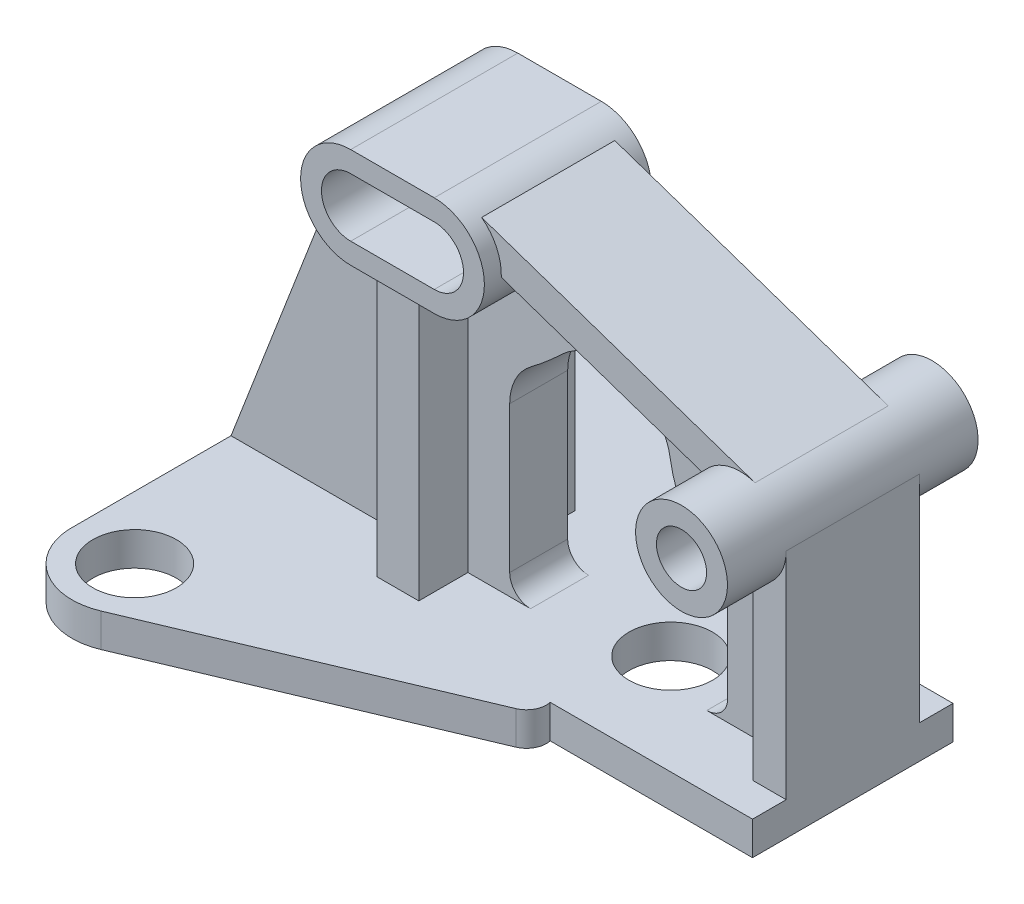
ISO-10303-21;
HEADER;
FILE_DESCRIPTION(('STEP AP214'),'2;1');
FILE_NAME('part.step','',(''),(''),'','','');
FILE_SCHEMA(('AUTOMOTIVE_DESIGN { 1 0 10303 214 1 1 1 1 }'));
ENDSEC;
DATA;
#1=APPLICATION_CONTEXT('core data for automotive mechanical design processes');
#2=APPLICATION_PROTOCOL_DEFINITION('international standard','automotive_design',2000,#1);
#3=PRODUCT_CONTEXT('',#1,'mechanical');
#4=PRODUCT('Part','Part','',(#3));
#5=PRODUCT_RELATED_PRODUCT_CATEGORY('part','',(#4));
#6=PRODUCT_DEFINITION_FORMATION('','',#4);
#7=PRODUCT_DEFINITION_CONTEXT('part definition',#1,'design');
#8=PRODUCT_DEFINITION('design','',#6,#7);
#9=PRODUCT_DEFINITION_SHAPE('','',#8);
#10=(LENGTH_UNIT() NAMED_UNIT(*) SI_UNIT(.MILLI.,.METRE.));
#11=(NAMED_UNIT(*) PLANE_ANGLE_UNIT() SI_UNIT($,.RADIAN.));
#12=(NAMED_UNIT(*) SI_UNIT($,.STERADIAN.) SOLID_ANGLE_UNIT());
#13=UNCERTAINTY_MEASURE_WITH_UNIT(LENGTH_MEASURE(1.E-05),#10,'distance_accuracy_value','');
#14=(GEOMETRIC_REPRESENTATION_CONTEXT(3) GLOBAL_UNCERTAINTY_ASSIGNED_CONTEXT((#13)) GLOBAL_UNIT_ASSIGNED_CONTEXT((#10,
#11,#12)) REPRESENTATION_CONTEXT('',''));
#15=CARTESIAN_POINT('',(0.,0.,0.));
#16=DIRECTION('',(0.,0.,1.));
#17=DIRECTION('',(1.,0.,0.));
#18=AXIS2_PLACEMENT_3D('',#15,#16,#17);
#19=CARTESIAN_POINT('',(32.5821720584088,59.5675036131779,-45.5));
#20=DIRECTION('',(0.,0.,1.));
#21=DIRECTION('',(1.,0.,0.));
#22=AXIS2_PLACEMENT_3D('',#19,#20,#21);
#23=CYLINDRICAL_SURFACE('',#22,11.);
#24=CARTESIAN_POINT('',(32.5821720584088,59.5675036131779,30.));
#25=DIRECTION('',(0.,0.,-1.));
#26=DIRECTION('',(-1.,0.,0.));
#27=AXIS2_PLACEMENT_3D('',#24,#25,#26);
#28=CIRCLE('',#27,11.);
#29=CARTESIAN_POINT('',(21.5821720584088,59.5675036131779,30.));
#30=VERTEX_POINT('',#29);
#31=EDGE_CURVE('E534',#30,#30,#28,.T.);
#32=ORIENTED_EDGE('',*,*,#31,.T.);
#33=EDGE_LOOP('',(#32));
#34=FACE_BOUND('',#33,.T.);
#35=CARTESIAN_POINT('',(32.5821720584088,59.5675036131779,-30.));
#36=DIRECTION('',(0.,0.,-1.));
#37=DIRECTION('',(-1.,0.,0.));
#38=AXIS2_PLACEMENT_3D('',#35,#36,#37);
#39=CIRCLE('',#38,11.);
#40=CARTESIAN_POINT('',(21.5821720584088,59.5675036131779,-30.));
#41=VERTEX_POINT('',#40);
#42=EDGE_CURVE('E533',#41,#41,#39,.T.);
#43=ORIENTED_EDGE('',*,*,#42,.F.);
#44=EDGE_LOOP('',(#43));
#45=FACE_BOUND('',#44,.T.);
#46=DIRECTION('',(0.,0.,1.));
#47=VECTOR('',#46,1.);
#48=CARTESIAN_POINT('',(43.5821720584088,59.5675036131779,-45.5));
#49=LINE('',#48,#47);
#50=CARTESIAN_POINT('',(43.5821720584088,59.5675036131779,-15.9413277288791));
#51=VERTEX_POINT('',#50);
#52=CARTESIAN_POINT('',(43.5821720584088,59.5675036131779,15.9413277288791));
#53=VERTEX_POINT('',#52);
#54=EDGE_CURVE('E625',#51,#53,#49,.T.);
#55=ORIENTED_EDGE('',*,*,#54,.F.);
#56=CARTESIAN_POINT('',(32.5821720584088,59.5675036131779,-15.9413277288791));
#57=DIRECTION('',(0.,0.,1.));
#58=DIRECTION('',(1.,0.,0.));
#59=AXIS2_PLACEMENT_3D('',#56,#57,#58);
#60=CIRCLE('',#59,11.);
#61=CARTESIAN_POINT('',(35.5821720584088,48.9844983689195,-15.9413277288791));
#62=VERTEX_POINT('',#61);
#63=EDGE_CURVE('E414',#51,#62,#60,.F.);
#64=ORIENTED_EDGE('',*,*,#63,.T.);
#65=DIRECTION('',(0.,0.,1.));
#66=VECTOR('',#65,1.);
#67=CARTESIAN_POINT('',(35.5821720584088,48.9844983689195,-15.9413277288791));
#68=LINE('',#67,#66);
#69=CARTESIAN_POINT('',(35.5821720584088,48.9844983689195,-6.94132772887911));
#70=VERTEX_POINT('',#69);
#71=EDGE_CURVE('E425',#62,#70,#68,.T.);
#72=ORIENTED_EDGE('',*,*,#71,.T.);
#73=CARTESIAN_POINT('',(32.5821720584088,59.5675036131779,-6.94132772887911));
#74=DIRECTION('',(0.,0.,1.));
#75=DIRECTION('',(1.,0.,0.));
#76=AXIS2_PLACEMENT_3D('',#73,#74,#75);
#77=CIRCLE('',#76,11.);
#78=CARTESIAN_POINT('',(23.5305824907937,65.8180016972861,-6.94132772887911));
#79=VERTEX_POINT('',#78);
#80=EDGE_CURVE('E541',#79,#70,#77,.T.);
#81=ORIENTED_EDGE('',*,*,#80,.F.);
#82=DIRECTION('',(0.,0.,1.));
#83=VECTOR('',#82,1.);
#84=CARTESIAN_POINT('',(23.5305824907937,65.8180016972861,-15.9413277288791));
#85=LINE('',#84,#83);
#86=CARTESIAN_POINT('',(23.5305824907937,65.8180016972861,-15.9413277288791));
#87=VERTEX_POINT('',#86);
#88=EDGE_CURVE('E447',#87,#79,#85,.T.);
#89=ORIENTED_EDGE('',*,*,#88,.F.);
#90=CARTESIAN_POINT('',(32.5821720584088,59.5675036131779,-15.9413277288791));
#91=DIRECTION('',(0.,0.,1.));
#92=DIRECTION('',(1.,0.,0.));
#93=AXIS2_PLACEMENT_3D('',#90,#91,#92);
#94=CIRCLE('',#93,11.);
#95=CARTESIAN_POINT('',(36.1271070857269,69.9806412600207,-15.9413277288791));
#96=VERTEX_POINT('',#95);
#97=EDGE_CURVE('E438',#87,#96,#94,.F.);
#98=ORIENTED_EDGE('',*,*,#97,.T.);
#99=DIRECTION('',(0.,0.,1.));
#100=VECTOR('',#99,1.);
#101=CARTESIAN_POINT('',(36.1271070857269,69.9806412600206,-45.5));
#102=LINE('',#101,#100);
#103=CARTESIAN_POINT('',(36.1271070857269,69.9806412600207,15.9413277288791));
#104=VERTEX_POINT('',#103);
#105=EDGE_CURVE('E628',#96,#104,#102,.T.);
#106=ORIENTED_EDGE('',*,*,#105,.T.);
#107=CARTESIAN_POINT('',(32.5821720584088,59.5675036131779,15.9413277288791));
#108=DIRECTION('',(0.,0.,1.));
#109=DIRECTION('',(1.,0.,0.));
#110=AXIS2_PLACEMENT_3D('',#107,#108,#109);
#111=CIRCLE('',#110,11.);
#112=CARTESIAN_POINT('',(23.5305824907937,65.8180016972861,15.9413277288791));
#113=VERTEX_POINT('',#112);
#114=EDGE_CURVE('E502',#113,#104,#111,.F.);
#115=ORIENTED_EDGE('',*,*,#114,.F.);
#116=DIRECTION('',(0.,0.,-1.));
#117=VECTOR('',#116,1.);
#118=CARTESIAN_POINT('',(23.5305824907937,65.8180016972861,15.9413277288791));
#119=LINE('',#118,#117);
#120=CARTESIAN_POINT('',(23.5305824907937,65.8180016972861,6.94132772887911));
#121=VERTEX_POINT('',#120);
#122=EDGE_CURVE('E508',#113,#121,#119,.T.);
#123=ORIENTED_EDGE('',*,*,#122,.T.);
#124=CARTESIAN_POINT('',(32.5821720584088,59.5675036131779,6.94132772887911));
#125=DIRECTION('',(0.,0.,-1.));
#126=DIRECTION('',(-1.,0.,0.));
#127=AXIS2_PLACEMENT_3D('',#124,#125,#126);
#128=CIRCLE('',#127,11.);
#129=CARTESIAN_POINT('',(35.5821720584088,48.9844983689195,6.94132772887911));
#130=VERTEX_POINT('',#129);
#131=EDGE_CURVE('E548',#130,#121,#128,.T.);
#132=ORIENTED_EDGE('',*,*,#131,.F.);
#133=DIRECTION('',(0.,0.,-1.));
#134=VECTOR('',#133,1.);
#135=CARTESIAN_POINT('',(35.5821720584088,48.9844983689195,15.9413277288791));
#136=LINE('',#135,#134);
#137=CARTESIAN_POINT('',(35.5821720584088,48.9844983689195,15.9413277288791));
#138=VERTEX_POINT('',#137);
#139=EDGE_CURVE('E493',#138,#130,#136,.T.);
#140=ORIENTED_EDGE('',*,*,#139,.F.);
#141=CARTESIAN_POINT('',(32.5821720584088,59.5675036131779,15.9413277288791));
#142=DIRECTION('',(0.,0.,1.));
#143=DIRECTION('',(1.,0.,0.));
#144=AXIS2_PLACEMENT_3D('',#141,#142,#143);
#145=CIRCLE('',#144,11.);
#146=EDGE_CURVE('E476',#53,#138,#145,.F.);
#147=ORIENTED_EDGE('',*,*,#146,.F.);
#148=EDGE_LOOP('',(#55,#64,#72,#81,#89,#98,#106,#115,#123,#132,#140,#147));
#149=FACE_BOUND('',#148,.T.);
#150=ADVANCED_FACE('F31',(#34,#45,#149),#23,.T.);
#151=CARTESIAN_POINT('',(-98.3431620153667,99.,-6.94132772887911));
#152=DIRECTION('',(0.,0.,1.));
#153=DIRECTION('',(1.,0.,0.));
#154=AXIS2_PLACEMENT_3D('',#151,#152,#153);
#155=PLANE('',#154);
#156=DIRECTION('',(0.,1.,0.));
#157=VECTOR('',#156,1.);
#158=CARTESIAN_POINT('',(-51.6125350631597,99.,-6.94132772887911));
#159=LINE('',#158,#157);
#160=CARTESIAN_POINT('',(-51.6125350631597,8.,-6.94132772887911));
#161=VERTEX_POINT('',#160);
#162=CARTESIAN_POINT('',(-51.6125350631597,70.7251134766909,-6.94132772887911));
#163=VERTEX_POINT('',#162);
#164=EDGE_CURVE('E459',#161,#163,#159,.T.);
#165=ORIENTED_EDGE('',*,*,#164,.F.);
#166=DIRECTION('',(-1.,0.,0.));
#167=VECTOR('',#166,1.);
#168=CARTESIAN_POINT('',(-98.3431620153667,8.,-6.94132772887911));
#169=LINE('',#168,#167);
#170=CARTESIAN_POINT('',(-98.330899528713,8.00000000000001,-6.94132772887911));
#171=VERTEX_POINT('',#170);
#172=EDGE_CURVE('E661',#161,#171,#169,.T.);
#173=ORIENTED_EDGE('',*,*,#172,.T.);
#174=DIRECTION('',(-0.360222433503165,-0.93286644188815,0.));
#175=VECTOR('',#174,1.);
#176=CARTESIAN_POINT('',(-67.7529035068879,87.1877009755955,-6.94132772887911));
#177=LINE('',#176,#175);
#178=CARTESIAN_POINT('',(-67.8069323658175,87.0477826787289,-6.94132772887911));
#179=VERTEX_POINT('',#178);
#180=EDGE_CURVE('E700',#179,#171,#177,.T.);
#181=ORIENTED_EDGE('',*,*,#180,.F.);
#182=CARTESIAN_POINT('',(-56.6125350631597,82.7251134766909,-6.94132772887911));
#183=DIRECTION('',(0.,0.,1.));
#184=DIRECTION('',(1.,0.,0.));
#185=AXIS2_PLACEMENT_3D('',#182,#183,#184);
#186=CIRCLE('',#185,12.);
#187=CARTESIAN_POINT('',(-56.6125350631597,70.7251134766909,-6.94132772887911));
#188=VERTEX_POINT('',#187);
#189=EDGE_CURVE('E598',#179,#188,#186,.T.);
#190=ORIENTED_EDGE('',*,*,#189,.T.);
#191=DIRECTION('',(1.,0.,0.));
#192=VECTOR('',#191,1.);
#193=CARTESIAN_POINT('',(-98.3431620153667,70.7251134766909,-6.94132772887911));
#194=LINE('',#193,#192);
#195=EDGE_CURVE('E782',#188,#163,#194,.T.);
#196=ORIENTED_EDGE('',*,*,#195,.T.);
#197=EDGE_LOOP('',(#165,#173,#181,#190,#196));
#198=FACE_BOUND('',#197,.T.);
#199=ADVANCED_FACE('F785',(#198),#155,.F.);
#200=CARTESIAN_POINT('',(-98.3431620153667,99.,6.94132772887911));
#201=DIRECTION('',(0.,0.,-1.));
#202=DIRECTION('',(-1.,0.,0.));
#203=AXIS2_PLACEMENT_3D('',#200,#201,#202);
#204=PLANE('',#203);
#205=CARTESIAN_POINT('',(32.5821720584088,59.5675036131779,6.94132772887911));
#206=DIRECTION('',(0.,0.,-1.));
#207=DIRECTION('',(1.,0.,0.));
#208=AXIS2_PLACEMENT_3D('',#205,#206,#207);
#209=CIRCLE('',#208,26.);
#210=CARTESIAN_POINT('',(20.5821720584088,36.5023784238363,6.94132772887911));
#211=VERTEX_POINT('',#210);
#212=CARTESIAN_POINT('',(6.88039535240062,55.6408416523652,6.94132772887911));
#213=VERTEX_POINT('',#212);
#214=EDGE_CURVE('E383',#211,#213,#209,.T.);
#215=ORIENTED_EDGE('',*,*,#214,.F.);
#216=DIRECTION('',(0.,1.,0.));
#217=VECTOR('',#216,1.);
#218=CARTESIAN_POINT('',(20.5821720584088,23.,6.94132772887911));
#219=LINE('',#218,#217);
#220=CARTESIAN_POINT('',(20.5821720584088,13.,6.94132772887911));
#221=VERTEX_POINT('',#220);
#222=EDGE_CURVE('E403',#221,#211,#219,.T.);
#223=ORIENTED_EDGE('',*,*,#222,.F.);
#224=CARTESIAN_POINT('',(15.5821720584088,13.,6.94132772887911));
#225=DIRECTION('',(0.,0.,-1.));
#226=DIRECTION('',(-1.,0.,0.));
#227=AXIS2_PLACEMENT_3D('',#224,#225,#226);
#228=CIRCLE('',#227,5.);
#229=CARTESIAN_POINT('',(15.5821720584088,8.,6.94132772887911));
#230=VERTEX_POINT('',#229);
#231=EDGE_CURVE('E730',#221,#230,#228,.T.);
#232=ORIENTED_EDGE('',*,*,#231,.T.);
#233=DIRECTION('',(1.,0.,0.));
#234=VECTOR('',#233,1.);
#235=CARTESIAN_POINT('',(-98.3431620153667,8.,6.94132772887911));
#236=LINE('',#235,#234);
#237=CARTESIAN_POINT('',(35.5821720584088,8.,6.94132772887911));
#238=VERTEX_POINT('',#237);
#239=EDGE_CURVE('E677',#230,#238,#236,.T.);
#240=ORIENTED_EDGE('',*,*,#239,.T.);
#241=DIRECTION('',(0.,-1.,0.));
#242=VECTOR('',#241,1.);
#243=CARTESIAN_POINT('',(35.5821720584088,-43.2131791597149,6.94132772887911));
#244=LINE('',#243,#242);
#245=EDGE_CURVE('E475',#130,#238,#244,.T.);
#246=ORIENTED_EDGE('',*,*,#245,.F.);
#247=ORIENTED_EDGE('',*,*,#131,.T.);
#248=DIRECTION('',(0.946648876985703,-0.322266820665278,0.));
#249=VECTOR('',#248,1.);
#250=CARTESIAN_POINT('',(36.58885574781,61.3725855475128,6.94132772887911));
#251=LINE('',#250,#249);
#252=CARTESIAN_POINT('',(-24.6235501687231,82.211069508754,6.94132772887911));
#253=VERTEX_POINT('',#252);
#254=EDGE_CURVE('E496',#253,#121,#251,.T.);
#255=ORIENTED_EDGE('',*,*,#254,.F.);
#256=CARTESIAN_POINT('',(-36.6125350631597,82.7251134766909,6.94132772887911));
#257=DIRECTION('',(0.,0.,-1.));
#258=DIRECTION('',(-1.,0.,0.));
#259=AXIS2_PLACEMENT_3D('',#256,#257,#258);
#260=CIRCLE('',#259,12.);
#261=CARTESIAN_POINT('',(-36.6125350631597,70.7251134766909,6.94132772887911));
#262=VERTEX_POINT('',#261);
#263=EDGE_CURVE('E605',#253,#262,#260,.T.);
#264=ORIENTED_EDGE('',*,*,#263,.T.);
#265=DIRECTION('',(-1.,0.,0.));
#266=VECTOR('',#265,1.);
#267=CARTESIAN_POINT('',(-98.3431620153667,70.7251134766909,6.94132772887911));
#268=LINE('',#267,#266);
#269=CARTESIAN_POINT('',(-41.6125350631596,70.7251134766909,6.94132772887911));
#270=VERTEX_POINT('',#269);
#271=EDGE_CURVE('E608',#262,#270,#268,.T.);
#272=ORIENTED_EDGE('',*,*,#271,.T.);
#273=DIRECTION('',(0.,-1.,0.));
#274=VECTOR('',#273,1.);
#275=CARTESIAN_POINT('',(-41.6125350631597,99.,6.94132772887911));
#276=LINE('',#275,#274);
#277=CARTESIAN_POINT('',(-41.6125350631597,8.,6.94132772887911));
#278=VERTEX_POINT('',#277);
#279=EDGE_CURVE('E526',#270,#278,#276,.T.);
#280=ORIENTED_EDGE('',*,*,#279,.T.);
#281=CARTESIAN_POINT('',(-26.6125350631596,8.,6.94132772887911));
#282=VERTEX_POINT('',#281);
#283=EDGE_CURVE('E674',#278,#282,#236,.T.);
#284=ORIENTED_EDGE('',*,*,#283,.T.);
#285=CARTESIAN_POINT('',(-26.6125350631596,13.,6.94132772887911));
#286=DIRECTION('',(0.,0.,-1.));
#287=DIRECTION('',(-1.,0.,0.));
#288=AXIS2_PLACEMENT_3D('',#285,#286,#287);
#289=CIRCLE('',#288,5.);
#290=CARTESIAN_POINT('',(-31.6125350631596,13.,6.94132772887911));
#291=VERTEX_POINT('',#290);
#292=EDGE_CURVE('E39',#282,#291,#289,.T.);
#293=ORIENTED_EDGE('',*,*,#292,.T.);
#294=DIRECTION('',(0.,-1.,0.));
#295=VECTOR('',#294,1.);
#296=CARTESIAN_POINT('',(-31.6125350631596,7.99999999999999,6.94132772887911));
#297=LINE('',#296,#295);
#298=CARTESIAN_POINT('',(-31.6125350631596,48.,6.94132772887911));
#299=VERTEX_POINT('',#298);
#300=EDGE_CURVE('E398',#299,#291,#297,.T.);
#301=ORIENTED_EDGE('',*,*,#300,.F.);
#302=CARTESIAN_POINT('',(-18.8581910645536,48.,6.94132772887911));
#303=DIRECTION('',(0.,0.,1.));
#304=DIRECTION('',(1.,0.,0.));
#305=AXIS2_PLACEMENT_3D('',#302,#303,#304);
#306=CIRCLE('',#305,12.7543439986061);
#307=CARTESIAN_POINT('',(-26.5451994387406,58.1775828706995,6.94132772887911));
#308=VERTEX_POINT('',#307);
#309=EDGE_CURVE('E396',#308,#299,#306,.T.);
#310=ORIENTED_EDGE('',*,*,#309,.F.);
#311=CARTESIAN_POINT('',(-77.1819102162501,125.220481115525,6.94132772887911));
#312=DIRECTION('',(0.,0.,-1.));
#313=DIRECTION('',(-1.,0.,0.));
#314=AXIS2_PLACEMENT_3D('',#311,#312,#313);
#315=CIRCLE('',#314,84.0168238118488);
#316=CARTESIAN_POINT('',(-19.1218481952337,64.4927618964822,6.94132772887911));
#317=VERTEX_POINT('',#316);
#318=EDGE_CURVE('E376',#317,#308,#315,.T.);
#319=ORIENTED_EDGE('',*,*,#318,.F.);
#320=CARTESIAN_POINT('',(-8.42340290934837,53.3027603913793,6.94132772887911));
#321=DIRECTION('',(0.,0.,1.));
#322=DIRECTION('',(-1.,0.,0.));
#323=AXIS2_PLACEMENT_3D('',#320,#321,#322);
#324=CIRCLE('',#323,15.4813715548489);
#325=EDGE_CURVE('E386',#213,#317,#324,.T.);
#326=ORIENTED_EDGE('',*,*,#325,.F.);
#327=EDGE_LOOP('',(#215,#223,#232,#240,#246,#247,#255,#264,#272,#280,#284,#293,#301,#310,#319,#326));
#328=FACE_BOUND('',#327,.T.);
#329=ADVANCED_FACE('F394',(#328),#204,.F.);
#330=CARTESIAN_POINT('',(-36.6125350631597,82.7251134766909,-45.5));
#331=DIRECTION('',(0.,0.,1.));
#332=DIRECTION('',(1.,0.,0.));
#333=AXIS2_PLACEMENT_3D('',#330,#331,#332);
#334=CYLINDRICAL_SURFACE('',#333,12.);
#335=DIRECTION('',(0.,0.,1.));
#336=VECTOR('',#335,1.);
#337=CARTESIAN_POINT('',(-29.3335256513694,92.2653452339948,-45.5));
#338=LINE('',#337,#336);
#339=CARTESIAN_POINT('',(-29.3335256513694,92.2653452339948,-15.9413277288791));
#340=VERTEX_POINT('',#339);
#341=CARTESIAN_POINT('',(-29.3335256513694,92.2653452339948,15.9413277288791));
#342=VERTEX_POINT('',#341);
#343=EDGE_CURVE('E631',#340,#342,#338,.T.);
#344=ORIENTED_EDGE('',*,*,#343,.F.);
#345=CARTESIAN_POINT('',(-36.6125350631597,82.7251134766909,-15.9413277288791));
#346=DIRECTION('',(0.,0.,1.));
#347=DIRECTION('',(1.,0.,0.));
#348=AXIS2_PLACEMENT_3D('',#345,#346,#347);
#349=CIRCLE('',#348,12.);
#350=CARTESIAN_POINT('',(-24.6235501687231,82.211069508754,-15.9413277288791));
#351=VERTEX_POINT('',#350);
#352=EDGE_CURVE('E433',#340,#351,#349,.F.);
#353=ORIENTED_EDGE('',*,*,#352,.T.);
#354=DIRECTION('',(0.,0.,1.));
#355=VECTOR('',#354,1.);
#356=CARTESIAN_POINT('',(-24.6235501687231,82.211069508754,-15.9413277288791));
#357=LINE('',#356,#355);
#358=CARTESIAN_POINT('',(-24.6235501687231,82.211069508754,-6.94132772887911));
#359=VERTEX_POINT('',#358);
#360=EDGE_CURVE('E444',#351,#359,#357,.T.);
#361=ORIENTED_EDGE('',*,*,#360,.T.);
#362=CARTESIAN_POINT('',(-36.6125350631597,82.7251134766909,-6.94132772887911));
#363=DIRECTION('',(0.,0.,1.));
#364=DIRECTION('',(1.,0.,0.));
#365=AXIS2_PLACEMENT_3D('',#362,#363,#364);
#366=CIRCLE('',#365,12.);
#367=CARTESIAN_POINT('',(-36.6125350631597,70.7251134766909,-6.94132772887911));
#368=VERTEX_POINT('',#367);
#369=EDGE_CURVE('E602',#368,#359,#366,.T.);
#370=ORIENTED_EDGE('',*,*,#369,.F.);
#371=DIRECTION('',(0.,0.,-1.));
#372=VECTOR('',#371,1.);
#373=CARTESIAN_POINT('',(-36.6125350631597,70.7251134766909,20.));
#374=LINE('',#373,#372);
#375=CARTESIAN_POINT('',(-36.6125350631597,70.7251134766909,-20.));
#376=VERTEX_POINT('',#375);
#377=EDGE_CURVE('E572',#368,#376,#374,.T.);
#378=ORIENTED_EDGE('',*,*,#377,.T.);
#379=CARTESIAN_POINT('',(-36.6125350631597,82.7251134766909,-20.));
#380=DIRECTION('',(0.,0.,-1.));
#381=DIRECTION('',(-1.,0.,0.));
#382=AXIS2_PLACEMENT_3D('',#379,#380,#381);
#383=CIRCLE('',#382,12.);
#384=CARTESIAN_POINT('',(-36.6125350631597,94.7251134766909,-20.));
#385=VERTEX_POINT('',#384);
#386=EDGE_CURVE('E577',#385,#376,#383,.T.);
#387=ORIENTED_EDGE('',*,*,#386,.F.);
#388=DIRECTION('',(0.,0.,1.));
#389=VECTOR('',#388,1.);
#390=CARTESIAN_POINT('',(-36.6125350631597,94.7251134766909,-45.5));
#391=LINE('',#390,#389);
#392=CARTESIAN_POINT('',(-36.6125350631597,94.7251134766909,20.));
#393=VERTEX_POINT('',#392);
#394=EDGE_CURVE('E633',#385,#393,#391,.T.);
#395=ORIENTED_EDGE('',*,*,#394,.T.);
#396=CARTESIAN_POINT('',(-36.6125350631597,82.7251134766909,20.));
#397=DIRECTION('',(0.,0.,-1.));
#398=DIRECTION('',(-1.,0.,0.));
#399=AXIS2_PLACEMENT_3D('',#396,#397,#398);
#400=CIRCLE('',#399,12.);
#401=CARTESIAN_POINT('',(-36.6125350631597,70.7251134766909,20.));
#402=VERTEX_POINT('',#401);
#403=EDGE_CURVE('E557',#393,#402,#400,.T.);
#404=ORIENTED_EDGE('',*,*,#403,.T.);
#405=EDGE_CURVE('E591',#402,#262,#374,.T.);
#406=ORIENTED_EDGE('',*,*,#405,.T.);
#407=ORIENTED_EDGE('',*,*,#263,.F.);
#408=DIRECTION('',(0.,0.,-1.));
#409=VECTOR('',#408,1.);
#410=CARTESIAN_POINT('',(-24.6235501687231,82.211069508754,15.9413277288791));
#411=LINE('',#410,#409);
#412=CARTESIAN_POINT('',(-24.6235501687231,82.211069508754,15.9413277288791));
#413=VERTEX_POINT('',#412);
#414=EDGE_CURVE('E513',#413,#253,#411,.T.);
#415=ORIENTED_EDGE('',*,*,#414,.F.);
#416=CARTESIAN_POINT('',(-36.6125350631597,82.7251134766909,15.9413277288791));
#417=DIRECTION('',(0.,0.,1.));
#418=DIRECTION('',(1.,0.,0.));
#419=AXIS2_PLACEMENT_3D('',#416,#417,#418);
#420=CIRCLE('',#419,12.);
#421=EDGE_CURVE('E497',#342,#413,#420,.F.);
#422=ORIENTED_EDGE('',*,*,#421,.F.);
#423=EDGE_LOOP('',(#344,#353,#361,#370,#378,#387,#395,#404,#406,#407,#415,#422));
#424=FACE_BOUND('',#423,.T.);
#425=ADVANCED_FACE('F999',(#424),#334,.T.);
#426=DIRECTION('',(0.,-1.,0.));
#427=VECTOR('',#426,1.);
#428=CARTESIAN_POINT('',(-51.6125350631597,99.,6.94132772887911));
#429=LINE('',#428,#427);
#430=CARTESIAN_POINT('',(-51.6125350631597,70.7251134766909,6.94132772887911));
#431=VERTEX_POINT('',#430);
#432=CARTESIAN_POINT('',(-51.6125350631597,8.,6.94132772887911));
#433=VERTEX_POINT('',#432);
#434=EDGE_CURVE('E519',#431,#433,#429,.T.);
#435=ORIENTED_EDGE('',*,*,#434,.F.);
#436=CARTESIAN_POINT('',(-56.6125350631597,70.7251134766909,6.94132772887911));
#437=VERTEX_POINT('',#436);
#438=EDGE_CURVE('E607',#431,#437,#268,.T.);
#439=ORIENTED_EDGE('',*,*,#438,.T.);
#440=CARTESIAN_POINT('',(-56.6125350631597,82.7251134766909,6.94132772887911));
#441=DIRECTION('',(0.,0.,-1.));
#442=DIRECTION('',(-1.,0.,0.));
#443=AXIS2_PLACEMENT_3D('',#440,#441,#442);
#444=CIRCLE('',#443,12.);
#445=CARTESIAN_POINT('',(-67.8069323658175,87.0477826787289,6.94132772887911));
#446=VERTEX_POINT('',#445);
#447=EDGE_CURVE('E600',#437,#446,#444,.T.);
#448=ORIENTED_EDGE('',*,*,#447,.T.);
#449=DIRECTION('',(0.360222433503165,0.93286644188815,0.));
#450=VECTOR('',#449,1.);
#451=CARTESIAN_POINT('',(-67.7529035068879,87.1877009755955,6.94132772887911));
#452=LINE('',#451,#450);
#453=CARTESIAN_POINT('',(-98.330899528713,8.00000000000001,6.94132772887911));
#454=VERTEX_POINT('',#453);
#455=EDGE_CURVE('E648',#454,#446,#452,.T.);
#456=ORIENTED_EDGE('',*,*,#455,.F.);
#457=EDGE_CURVE('E669',#454,#433,#236,.T.);
#458=ORIENTED_EDGE('',*,*,#457,.T.);
#459=EDGE_LOOP('',(#435,#439,#448,#456,#458));
#460=FACE_BOUND('',#459,.T.);
#461=ADVANCED_FACE('F815',(#460),#204,.F.);
#462=CARTESIAN_POINT('',(-198.960102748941,8.,8.11609997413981));
#463=DIRECTION('',(0.,1.,0.));
#464=DIRECTION('',(0.,0.,1.));
#465=AXIS2_PLACEMENT_3D('',#462,#463,#464);
#466=PLANE('',#465);
#467=CARTESIAN_POINT('',(0.,8.,0.));
#468=DIRECTION('',(0.,1.,0.));
#469=DIRECTION('',(0.,0.,1.));
#470=AXIS2_PLACEMENT_3D('',#467,#468,#469);
#471=CIRCLE('',#470,10.);
#472=CARTESIAN_POINT('',(0.,8.,10.));
#473=VERTEX_POINT('',#472);
#474=EDGE_CURVE('E392',#473,#473,#471,.T.);
#475=ORIENTED_EDGE('',*,*,#474,.F.);
#476=EDGE_LOOP('',(#475));
#477=FACE_BOUND('',#476,.T.);
#478=ORIENTED_EDGE('',*,*,#239,.F.);
#479=DIRECTION('',(0.,0.,1.));
#480=VECTOR('',#479,1.);
#481=CARTESIAN_POINT('',(15.5821720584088,8.,8.11609997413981));
#482=LINE('',#481,#480);
#483=CARTESIAN_POINT('',(15.5821720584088,8.,-6.94132772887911));
#484=VERTEX_POINT('',#483);
#485=EDGE_CURVE('E726',#230,#484,#482,.F.);
#486=ORIENTED_EDGE('',*,*,#485,.T.);
#487=CARTESIAN_POINT('',(35.5821720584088,8.,-6.94132772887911));
#488=VERTEX_POINT('',#487);
#489=EDGE_CURVE('E703',#488,#484,#169,.T.);
#490=ORIENTED_EDGE('',*,*,#489,.F.);
#491=DIRECTION('',(0.,0.,1.));
#492=VECTOR('',#491,1.);
#493=CARTESIAN_POINT('',(35.5821720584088,8.,-15.9413277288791));
#494=LINE('',#493,#492);
#495=CARTESIAN_POINT('',(35.5821720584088,8.,-15.9413277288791));
#496=VERTEX_POINT('',#495);
#497=EDGE_CURVE('E430',#496,#488,#494,.T.);
#498=ORIENTED_EDGE('',*,*,#497,.F.);
#499=DIRECTION('',(1.,0.,0.));
#500=VECTOR('',#499,1.);
#501=CARTESIAN_POINT('',(0.984818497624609,8.,-15.9413277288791));
#502=LINE('',#501,#500);
#503=CARTESIAN_POINT('',(43.5821720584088,8.00000000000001,-15.9413277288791));
#504=VERTEX_POINT('',#503);
#505=EDGE_CURVE('E419',#496,#504,#502,.T.);
#506=ORIENTED_EDGE('',*,*,#505,.T.);
#507=DIRECTION('',(0.,0.,1.));
#508=VECTOR('',#507,1.);
#509=CARTESIAN_POINT('',(43.5821720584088,8.,8.11609997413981));
#510=LINE('',#509,#508);
#511=CARTESIAN_POINT('',(43.5821720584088,8.,-24.));
#512=VERTEX_POINT('',#511);
#513=EDGE_CURVE('E683',#512,#504,#510,.T.);
#514=ORIENTED_EDGE('',*,*,#513,.F.);
#515=DIRECTION('',(1.,0.,0.));
#516=VECTOR('',#515,1.);
#517=CARTESIAN_POINT('',(-198.960102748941,8.,-24.));
#518=LINE('',#517,#516);
#519=CARTESIAN_POINT('',(-4.84935181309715,8.,-24.));
#520=VERTEX_POINT('',#519);
#521=EDGE_CURVE('E691',#520,#512,#518,.T.);
#522=ORIENTED_EDGE('',*,*,#521,.F.);
#523=CARTESIAN_POINT('',(-9.52877956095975,8.,-25.));
#524=DIRECTION('',(0.,1.,0.));
#525=DIRECTION('',(0.,0.,1.));
#526=AXIS2_PLACEMENT_3D('',#523,#524,#525);
#527=CIRCLE('',#526,4.78508558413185);
#528=CARTESIAN_POINT('',(-7.6718936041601,8.,-29.4101041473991));
#529=VERTEX_POINT('',#528);
#530=EDGE_CURVE('E961',#529,#520,#527,.F.);
#531=ORIENTED_EDGE('',*,*,#530,.F.);
#532=DIRECTION('',(0.921635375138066,0.,0.388057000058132));
#533=VECTOR('',#532,1.);
#534=CARTESIAN_POINT('',(-156.733212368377,8.,-92.1727646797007));
#535=LINE('',#534,#533);
#536=CARTESIAN_POINT('',(-77.5311564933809,8.,-58.824530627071));
#537=VERTEX_POINT('',#536);
#538=EDGE_CURVE('E927',#537,#529,#535,.T.);
#539=ORIENTED_EDGE('',*,*,#538,.F.);
#540=CARTESIAN_POINT('',(-83.3520114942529,8.,-45.));
#541=DIRECTION('',(0.,1.,0.));
#542=DIRECTION('',(0.,0.,1.));
#543=AXIS2_PLACEMENT_3D('',#540,#541,#542);
#544=CIRCLE('',#543,15.);
#545=CARTESIAN_POINT('',(-98.3436758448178,8.,-45.5));
#546=VERTEX_POINT('',#545);
#547=EDGE_CURVE('E954',#537,#546,#544,.T.);
#548=ORIENTED_EDGE('',*,*,#547,.T.);
#549=DIRECTION('',(1.,0.,0.));
#550=VECTOR('',#549,1.);
#551=CARTESIAN_POINT('',(-198.960102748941,8.,-45.5));
#552=LINE('',#551,#550);
#553=CARTESIAN_POINT('',(-98.330899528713,8.00000000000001,-45.5));
#554=VERTEX_POINT('',#553);
#555=EDGE_CURVE('E658',#546,#554,#552,.T.);
#556=ORIENTED_EDGE('',*,*,#555,.T.);
#557=DIRECTION('',(0.,0.,1.));
#558=VECTOR('',#557,1.);
#559=CARTESIAN_POINT('',(-98.330899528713,8.00000000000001,-45.5));
#560=LINE('',#559,#558);
#561=EDGE_CURVE('E641',#554,#171,#560,.T.);
#562=ORIENTED_EDGE('',*,*,#561,.T.);
#563=ORIENTED_EDGE('',*,*,#172,.F.);
#564=DIRECTION('',(0.,0.,-1.));
#565=VECTOR('',#564,1.);
#566=CARTESIAN_POINT('',(-51.6125350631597,8.,8.11609997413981));
#567=LINE('',#566,#565);
#568=CARTESIAN_POINT('',(-51.6125350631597,8.,-18.7059122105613));
#569=VERTEX_POINT('',#568);
#570=EDGE_CURVE('E461',#161,#569,#567,.T.);
#571=ORIENTED_EDGE('',*,*,#570,.T.);
#572=DIRECTION('',(1.,0.,0.));
#573=VECTOR('',#572,1.);
#574=CARTESIAN_POINT('',(-198.960102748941,8.,-18.7059122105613));
#575=LINE('',#574,#573);
#576=CARTESIAN_POINT('',(-41.6125350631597,8.,-18.7059122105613));
#577=VERTEX_POINT('',#576);
#578=EDGE_CURVE('E473',#577,#569,#575,.F.);
#579=ORIENTED_EDGE('',*,*,#578,.F.);
#580=DIRECTION('',(0.,0.,-1.));
#581=VECTOR('',#580,1.);
#582=CARTESIAN_POINT('',(-41.6125350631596,8.,8.11609997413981));
#583=LINE('',#582,#581);
#584=CARTESIAN_POINT('',(-41.6125350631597,8.,-6.94132772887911));
#585=VERTEX_POINT('',#584);
#586=EDGE_CURVE('E469',#585,#577,#583,.T.);
#587=ORIENTED_EDGE('',*,*,#586,.F.);
#588=CARTESIAN_POINT('',(-26.6125350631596,8.,-6.94132772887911));
#589=VERTEX_POINT('',#588);
#590=EDGE_CURVE('E705',#589,#585,#169,.T.);
#591=ORIENTED_EDGE('',*,*,#590,.F.);
#592=DIRECTION('',(0.,0.,1.));
#593=VECTOR('',#592,1.);
#594=CARTESIAN_POINT('',(-26.6125350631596,8.,8.11609997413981));
#595=LINE('',#594,#593);
#596=EDGE_CURVE('E723',#589,#282,#595,.T.);
#597=ORIENTED_EDGE('',*,*,#596,.T.);
#598=ORIENTED_EDGE('',*,*,#283,.F.);
#599=DIRECTION('',(0.,0.,-1.));
#600=VECTOR('',#599,1.);
#601=CARTESIAN_POINT('',(-41.6125350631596,8.,8.11609997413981));
#602=LINE('',#601,#600);
#603=CARTESIAN_POINT('',(-41.6125350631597,8.,18.7059122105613));
#604=VERTEX_POINT('',#603);
#605=EDGE_CURVE('E529',#604,#278,#602,.T.);
#606=ORIENTED_EDGE('',*,*,#605,.F.);
#607=DIRECTION('',(1.,0.,0.));
#608=VECTOR('',#607,1.);
#609=CARTESIAN_POINT('',(-198.960102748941,8.,18.7059122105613));
#610=LINE('',#609,#608);
#611=CARTESIAN_POINT('',(-51.6125350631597,8.,18.7059122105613));
#612=VERTEX_POINT('',#611);
#613=EDGE_CURVE('E531',#612,#604,#610,.T.);
#614=ORIENTED_EDGE('',*,*,#613,.F.);
#615=DIRECTION('',(0.,0.,-1.));
#616=VECTOR('',#615,1.);
#617=CARTESIAN_POINT('',(-51.6125350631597,8.,8.11609997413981));
#618=LINE('',#617,#616);
#619=EDGE_CURVE('E523',#612,#433,#618,.T.);
#620=ORIENTED_EDGE('',*,*,#619,.T.);
#621=ORIENTED_EDGE('',*,*,#457,.F.);
#622=CARTESIAN_POINT('',(-98.330899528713,8.00000000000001,45.5));
#623=VERTEX_POINT('',#622);
#624=EDGE_CURVE('E645',#454,#623,#560,.T.);
#625=ORIENTED_EDGE('',*,*,#624,.T.);
#626=DIRECTION('',(1.,0.,0.));
#627=VECTOR('',#626,1.);
#628=CARTESIAN_POINT('',(-198.960102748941,8.,45.5));
#629=LINE('',#628,#627);
#630=CARTESIAN_POINT('',(-98.3309682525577,8.,45.5));
#631=VERTEX_POINT('',#630);
#632=EDGE_CURVE('E654',#631,#623,#629,.T.);
#633=ORIENTED_EDGE('',*,*,#632,.F.);
#634=DIRECTION('',(0.00023252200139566,0.,0.999999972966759));
#635=VECTOR('',#634,1.);
#636=CARTESIAN_POINT('',(-98.3396662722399,8.,8.09270350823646));
#637=LINE('',#636,#635);
#638=CARTESIAN_POINT('',(-98.330899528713,8.,45.7955584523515));
#639=VERTEX_POINT('',#638);
#640=EDGE_CURVE('E951',#631,#639,#637,.T.);
#641=ORIENTED_EDGE('',*,*,#640,.T.);
#642=CARTESIAN_POINT('',(-83.3520114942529,8.,45.));
#643=DIRECTION('',(0.,1.,0.));
#644=DIRECTION('',(0.,0.,1.));
#645=AXIS2_PLACEMENT_3D('',#642,#643,#644);
#646=CIRCLE('',#645,15.);
#647=CARTESIAN_POINT('',(-77.5311564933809,8.,58.8245306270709));
#648=VERTEX_POINT('',#647);
#649=EDGE_CURVE('E664',#648,#639,#646,.F.);
#650=ORIENTED_EDGE('',*,*,#649,.F.);
#651=DIRECTION('',(0.921635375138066,0.,-0.388057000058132));
#652=VECTOR('',#651,1.);
#653=CARTESIAN_POINT('',(-162.538610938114,8.,94.6171430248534));
#654=LINE('',#653,#652);
#655=CARTESIAN_POINT('',(-7.6718936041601,8.,29.4101041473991));
#656=VERTEX_POINT('',#655);
#657=EDGE_CURVE('E890',#648,#656,#654,.T.);
#658=ORIENTED_EDGE('',*,*,#657,.T.);
#659=CARTESIAN_POINT('',(-9.52877956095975,8.,25.));
#660=DIRECTION('',(0.,1.,0.));
#661=DIRECTION('',(0.,0.,1.));
#662=AXIS2_PLACEMENT_3D('',#659,#660,#661);
#663=CIRCLE('',#662,4.78508558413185);
#664=CARTESIAN_POINT('',(-4.84935181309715,8.,24.));
#665=VERTEX_POINT('',#664);
#666=EDGE_CURVE('E948',#656,#665,#663,.T.);
#667=ORIENTED_EDGE('',*,*,#666,.T.);
#668=DIRECTION('',(1.,0.,0.));
#669=VECTOR('',#668,1.);
#670=CARTESIAN_POINT('',(-198.960102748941,8.,24.));
#671=LINE('',#670,#669);
#672=CARTESIAN_POINT('',(43.5821720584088,8.,24.));
#673=VERTEX_POINT('',#672);
#674=EDGE_CURVE('E684',#665,#673,#671,.T.);
#675=ORIENTED_EDGE('',*,*,#674,.T.);
#676=CARTESIAN_POINT('',(43.5821720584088,8.00000000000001,15.9413277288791));
#677=VERTEX_POINT('',#676);
#678=EDGE_CURVE('E680',#677,#673,#510,.T.);
#679=ORIENTED_EDGE('',*,*,#678,.F.);
#680=DIRECTION('',(1.,0.,0.));
#681=VECTOR('',#680,1.);
#682=CARTESIAN_POINT('',(0.984818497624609,8.,15.9413277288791));
#683=LINE('',#682,#681);
#684=CARTESIAN_POINT('',(35.5821720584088,8.,15.9413277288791));
#685=VERTEX_POINT('',#684);
#686=EDGE_CURVE('E482',#685,#677,#683,.T.);
#687=ORIENTED_EDGE('',*,*,#686,.F.);
#688=DIRECTION('',(0.,0.,-1.));
#689=VECTOR('',#688,1.);
#690=CARTESIAN_POINT('',(35.5821720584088,8.,15.9413277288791));
#691=LINE('',#690,#689);
#692=EDGE_CURVE('E488',#685,#238,#691,.T.);
#693=ORIENTED_EDGE('',*,*,#692,.T.);
#694=EDGE_LOOP('',(#478,#486,#490,#498,#506,#514,#522,#531,#539,#548,#556,#562,#563,#571,#579,
#587,#591,#597,#598,#606,#614,#620,#621,#625,#633,#641,#650,#658,#667,#675,#679,#687,#693));
#695=FACE_BOUND('',#694,.T.);
#696=CARTESIAN_POINT('',(-83.3520114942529,8.,-45.));
#697=DIRECTION('',(0.,1.,0.));
#698=DIRECTION('',(0.,0.,1.));
#699=AXIS2_PLACEMENT_3D('',#696,#697,#698);
#700=CIRCLE('',#699,9.99999999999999);
#701=CARTESIAN_POINT('',(-83.3520114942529,8.,-35.));
#702=VERTEX_POINT('',#701);
#703=EDGE_CURVE('E953',#702,#702,#700,.T.);
#704=ORIENTED_EDGE('',*,*,#703,.F.);
#705=EDGE_LOOP('',(#704));
#706=FACE_BOUND('',#705,.T.);
#707=CARTESIAN_POINT('',(-83.3520114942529,8.,45.));
#708=DIRECTION('',(0.,1.,0.));
#709=DIRECTION('',(0.,0.,1.));
#710=AXIS2_PLACEMENT_3D('',#707,#708,#709);
#711=CIRCLE('',#710,9.99999999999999);
#712=CARTESIAN_POINT('',(-83.3520114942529,8.,55.));
#713=VERTEX_POINT('',#712);
#714=EDGE_CURVE('E868',#713,#713,#711,.F.);
#715=ORIENTED_EDGE('',*,*,#714,.T.);
#716=EDGE_LOOP('',(#715));
#717=FACE_BOUND('',#716,.T.);
#718=ADVANCED_FACE('F767',(#477,#695,#706,#717),#466,.T.);
#719=CARTESIAN_POINT('',(43.5821720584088,8.,8.11609997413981));
#720=DIRECTION('',(1.,0.,0.));
#721=DIRECTION('',(0.,0.,-1.));
#722=AXIS2_PLACEMENT_3D('',#719,#720,#721);
#723=PLANE('',#722);
#724=ORIENTED_EDGE('',*,*,#513,.T.);
#725=DIRECTION('',(0.,-1.,0.));
#726=VECTOR('',#725,1.);
#727=CARTESIAN_POINT('',(43.5821720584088,-43.2131791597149,-15.9413277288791));
#728=LINE('',#727,#726);
#729=EDGE_CURVE('E417',#51,#504,#728,.T.);
#730=ORIENTED_EDGE('',*,*,#729,.F.);
#731=ORIENTED_EDGE('',*,*,#54,.T.);
#732=DIRECTION('',(0.,-1.,0.));
#733=VECTOR('',#732,1.);
#734=CARTESIAN_POINT('',(43.5821720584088,-43.2131791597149,15.9413277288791));
#735=LINE('',#734,#733);
#736=EDGE_CURVE('E485',#53,#677,#735,.T.);
#737=ORIENTED_EDGE('',*,*,#736,.T.);
#738=ORIENTED_EDGE('',*,*,#678,.T.);
#739=DIRECTION('',(0.,-1.,0.));
#740=VECTOR('',#739,1.);
#741=CARTESIAN_POINT('',(43.5821720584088,8.,24.));
#742=LINE('',#741,#740);
#743=CARTESIAN_POINT('',(43.5821720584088,0.,24.));
#744=VERTEX_POINT('',#743);
#745=EDGE_CURVE('E877',#673,#744,#742,.T.);
#746=ORIENTED_EDGE('',*,*,#745,.T.);
#747=DIRECTION('',(0.,0.,1.));
#748=VECTOR('',#747,1.);
#749=CARTESIAN_POINT('',(43.5821720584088,0.,8.11609997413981));
#750=LINE('',#749,#748);
#751=CARTESIAN_POINT('',(43.5821720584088,0.,-24.));
#752=VERTEX_POINT('',#751);
#753=EDGE_CURVE('E908',#752,#744,#750,.T.);
#754=ORIENTED_EDGE('',*,*,#753,.F.);
#755=DIRECTION('',(0.,-1.,0.));
#756=VECTOR('',#755,1.);
#757=CARTESIAN_POINT('',(43.5821720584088,8.,-24.));
#758=LINE('',#757,#756);
#759=EDGE_CURVE('E875',#512,#752,#758,.T.);
#760=ORIENTED_EDGE('',*,*,#759,.F.);
#761=EDGE_LOOP('',(#724,#730,#731,#737,#738,#746,#754,#760));
#762=FACE_BOUND('',#761,.T.);
#763=ADVANCED_FACE('F940',(#762),#723,.T.);
#764=CARTESIAN_POINT('',(-83.3520114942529,8.,-45.));
#765=DIRECTION('',(0.,-1.,0.));
#766=DIRECTION('',(0.,0.,-1.));
#767=AXIS2_PLACEMENT_3D('',#764,#765,#766);
#768=CYLINDRICAL_SURFACE('',#767,15.);
#769=DIRECTION('',(0.,-1.,0.));
#770=VECTOR('',#769,1.);
#771=CARTESIAN_POINT('',(-98.3436758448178,8.,-45.5));
#772=LINE('',#771,#770);
#773=CARTESIAN_POINT('',(-98.3436758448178,0.,-45.5));
#774=VERTEX_POINT('',#773);
#775=EDGE_CURVE('E656',#546,#774,#772,.T.);
#776=ORIENTED_EDGE('',*,*,#775,.F.);
#777=ORIENTED_EDGE('',*,*,#547,.F.);
#778=DIRECTION('',(0.,-1.,0.));
#779=VECTOR('',#778,1.);
#780=CARTESIAN_POINT('',(-77.5311564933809,8.,-58.824530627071));
#781=LINE('',#780,#779);
#782=CARTESIAN_POINT('',(-77.5311564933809,0.,-58.824530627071));
#783=VERTEX_POINT('',#782);
#784=EDGE_CURVE('E867',#537,#783,#781,.T.);
#785=ORIENTED_EDGE('',*,*,#784,.T.);
#786=CARTESIAN_POINT('',(-83.3520114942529,0.,-45.));
#787=DIRECTION('',(0.,1.,0.));
#788=DIRECTION('',(0.,0.,1.));
#789=AXIS2_PLACEMENT_3D('',#786,#787,#788);
#790=CIRCLE('',#789,15.);
#791=EDGE_CURVE('E860',#783,#774,#790,.T.);
#792=ORIENTED_EDGE('',*,*,#791,.T.);
#793=EDGE_LOOP('',(#776,#777,#785,#792));
#794=FACE_BOUND('',#793,.T.);
#795=ADVANCED_FACE('F846',(#794),#768,.T.);
#796=CARTESIAN_POINT('',(-198.960102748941,0.,8.11609997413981));
#797=DIRECTION('',(0.,1.,0.));
#798=DIRECTION('',(0.,0.,1.));
#799=AXIS2_PLACEMENT_3D('',#796,#797,#798);
#800=PLANE('',#799);
#801=CARTESIAN_POINT('',(0.,0.,0.));
#802=DIRECTION('',(0.,-1.,0.));
#803=DIRECTION('',(0.,0.,-1.));
#804=AXIS2_PLACEMENT_3D('',#801,#802,#803);
#805=CIRCLE('',#804,10.);
#806=CARTESIAN_POINT('',(0.,0.,-10.));
#807=VERTEX_POINT('',#806);
#808=EDGE_CURVE('E1010',#807,#807,#805,.T.);
#809=ORIENTED_EDGE('',*,*,#808,.F.);
#810=EDGE_LOOP('',(#809));
#811=FACE_BOUND('',#810,.T.);
#812=CARTESIAN_POINT('',(-9.52877956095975,0.,25.));
#813=DIRECTION('',(0.,1.,0.));
#814=DIRECTION('',(0.,0.,1.));
#815=AXIS2_PLACEMENT_3D('',#812,#813,#814);
#816=CIRCLE('',#815,4.78508558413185);
#817=CARTESIAN_POINT('',(-7.6718936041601,0.,29.4101041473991));
#818=VERTEX_POINT('',#817);
#819=CARTESIAN_POINT('',(-4.84935181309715,0.,24.));
#820=VERTEX_POINT('',#819);
#821=EDGE_CURVE('E844',#818,#820,#816,.T.);
#822=ORIENTED_EDGE('',*,*,#821,.F.);
#823=DIRECTION('',(0.921635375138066,0.,-0.388057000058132));
#824=VECTOR('',#823,1.);
#825=CARTESIAN_POINT('',(-162.538610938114,0.,94.6171430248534));
#826=LINE('',#825,#824);
#827=CARTESIAN_POINT('',(-77.5311564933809,0.,58.8245306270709));
#828=VERTEX_POINT('',#827);
#829=EDGE_CURVE('E889',#828,#818,#826,.T.);
#830=ORIENTED_EDGE('',*,*,#829,.F.);
#831=CARTESIAN_POINT('',(-83.3520114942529,0.,45.));
#832=DIRECTION('',(0.,1.,0.));
#833=DIRECTION('',(0.,0.,1.));
#834=AXIS2_PLACEMENT_3D('',#831,#832,#833);
#835=CIRCLE('',#834,15.);
#836=CARTESIAN_POINT('',(-98.330899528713,0.,45.7955584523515));
#837=VERTEX_POINT('',#836);
#838=EDGE_CURVE('E896',#828,#837,#835,.F.);
#839=ORIENTED_EDGE('',*,*,#838,.T.);
#840=DIRECTION('',(0.00023252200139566,0.,0.999999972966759));
#841=VECTOR('',#840,1.);
#842=CARTESIAN_POINT('',(-98.3396662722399,0.,8.09270350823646));
#843=LINE('',#842,#841);
#844=CARTESIAN_POINT('',(-98.3309682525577,0.,45.5));
#845=VERTEX_POINT('',#844);
#846=EDGE_CURVE('E857',#845,#837,#843,.T.);
#847=ORIENTED_EDGE('',*,*,#846,.F.);
#848=DIRECTION('',(1.,0.,0.));
#849=VECTOR('',#848,1.);
#850=CARTESIAN_POINT('',(-198.960102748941,0.,45.5));
#851=LINE('',#850,#849);
#852=CARTESIAN_POINT('',(-98.330899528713,0.,45.5));
#853=VERTEX_POINT('',#852);
#854=EDGE_CURVE('E821',#845,#853,#851,.T.);
#855=ORIENTED_EDGE('',*,*,#854,.T.);
#856=DIRECTION('',(0.,0.,1.));
#857=VECTOR('',#856,1.);
#858=CARTESIAN_POINT('',(-98.330899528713,0.,8.11609997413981));
#859=LINE('',#858,#857);
#860=CARTESIAN_POINT('',(-98.330899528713,0.,-45.5));
#861=VERTEX_POINT('',#860);
#862=EDGE_CURVE('E630',#861,#853,#859,.T.);
#863=ORIENTED_EDGE('',*,*,#862,.F.);
#864=DIRECTION('',(1.,0.,0.));
#865=VECTOR('',#864,1.);
#866=CARTESIAN_POINT('',(-198.960102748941,0.,-45.5));
#867=LINE('',#866,#865);
#868=EDGE_CURVE('E794',#774,#861,#867,.T.);
#869=ORIENTED_EDGE('',*,*,#868,.F.);
#870=ORIENTED_EDGE('',*,*,#791,.F.);
#871=DIRECTION('',(0.921635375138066,0.,0.388057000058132));
#872=VECTOR('',#871,1.);
#873=CARTESIAN_POINT('',(-156.733212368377,0.,-92.1727646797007));
#874=LINE('',#873,#872);
#875=CARTESIAN_POINT('',(-7.6718936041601,0.,-29.4101041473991));
#876=VERTEX_POINT('',#875);
#877=EDGE_CURVE('E917',#783,#876,#874,.T.);
#878=ORIENTED_EDGE('',*,*,#877,.T.);
#879=CARTESIAN_POINT('',(-9.52877956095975,0.,-25.));
#880=DIRECTION('',(0.,1.,0.));
#881=DIRECTION('',(0.,0.,1.));
#882=AXIS2_PLACEMENT_3D('',#879,#880,#881);
#883=CIRCLE('',#882,4.78508558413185);
#884=CARTESIAN_POINT('',(-4.84935181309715,0.,-24.));
#885=VERTEX_POINT('',#884);
#886=EDGE_CURVE('E914',#876,#885,#883,.F.);
#887=ORIENTED_EDGE('',*,*,#886,.T.);
#888=DIRECTION('',(1.,0.,0.));
#889=VECTOR('',#888,1.);
#890=CARTESIAN_POINT('',(-198.960102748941,0.,-24.));
#891=LINE('',#890,#889);
#892=EDGE_CURVE('E911',#885,#752,#891,.T.);
#893=ORIENTED_EDGE('',*,*,#892,.T.);
#894=ORIENTED_EDGE('',*,*,#753,.T.);
#895=DIRECTION('',(1.,0.,0.));
#896=VECTOR('',#895,1.);
#897=CARTESIAN_POINT('',(-198.960102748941,0.,24.));
#898=LINE('',#897,#896);
#899=EDGE_CURVE('E905',#820,#744,#898,.T.);
#900=ORIENTED_EDGE('',*,*,#899,.F.);
#901=EDGE_LOOP('',(#822,#830,#839,#847,#855,#863,#869,#870,#878,#887,#893,#894,#900));
#902=FACE_BOUND('',#901,.T.);
#903=CARTESIAN_POINT('',(-83.3520114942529,0.,45.));
#904=DIRECTION('',(0.,1.,0.));
#905=DIRECTION('',(0.,0.,1.));
#906=AXIS2_PLACEMENT_3D('',#903,#904,#905);
#907=CIRCLE('',#906,9.99999999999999);
#908=CARTESIAN_POINT('',(-83.3520114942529,0.,55.));
#909=VERTEX_POINT('',#908);
#910=EDGE_CURVE('E852',#909,#909,#907,.F.);
#911=ORIENTED_EDGE('',*,*,#910,.F.);
#912=EDGE_LOOP('',(#911));
#913=FACE_BOUND('',#912,.T.);
#914=CARTESIAN_POINT('',(-83.3520114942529,0.,-45.));
#915=DIRECTION('',(0.,1.,0.));
#916=DIRECTION('',(0.,0.,1.));
#917=AXIS2_PLACEMENT_3D('',#914,#915,#916);
#918=CIRCLE('',#917,9.99999999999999);
#919=CARTESIAN_POINT('',(-83.3520114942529,0.,-35.));
#920=VERTEX_POINT('',#919);
#921=EDGE_CURVE('E855',#920,#920,#918,.T.);
#922=ORIENTED_EDGE('',*,*,#921,.T.);
#923=EDGE_LOOP('',(#922));
#924=FACE_BOUND('',#923,.T.);
#925=ADVANCED_FACE('F840',(#811,#902,#913,#924),#800,.F.);
#926=ORIENTED_EDGE('',*,*,#489,.T.);
#927=CARTESIAN_POINT('',(15.5821720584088,13.,-6.94132772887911));
#928=DIRECTION('',(0.,0.,1.));
#929=DIRECTION('',(1.,0.,0.));
#930=AXIS2_PLACEMENT_3D('',#927,#928,#929);
#931=CIRCLE('',#930,5.);
#932=CARTESIAN_POINT('',(20.5821720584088,13.,-6.94132772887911));
#933=VERTEX_POINT('',#932);
#934=EDGE_CURVE('E733',#484,#933,#931,.T.);
#935=ORIENTED_EDGE('',*,*,#934,.T.);
#936=DIRECTION('',(0.,1.,0.));
#937=VECTOR('',#936,1.);
#938=CARTESIAN_POINT('',(20.5821720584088,99.,-6.94132772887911));
#939=LINE('',#938,#937);
#940=CARTESIAN_POINT('',(20.5821720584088,36.5023784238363,-6.94132772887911));
#941=VERTEX_POINT('',#940);
#942=EDGE_CURVE('E718',#933,#941,#939,.T.);
#943=ORIENTED_EDGE('',*,*,#942,.T.);
#944=CARTESIAN_POINT('',(32.5821720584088,59.5675036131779,-6.94132772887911));
#945=DIRECTION('',(0.,0.,1.));
#946=DIRECTION('',(1.,0.,0.));
#947=AXIS2_PLACEMENT_3D('',#944,#945,#946);
#948=CIRCLE('',#947,26.);
#949=CARTESIAN_POINT('',(6.88039535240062,55.6408416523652,-6.94132772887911));
#950=VERTEX_POINT('',#949);
#951=EDGE_CURVE('E715',#941,#950,#948,.F.);
#952=ORIENTED_EDGE('',*,*,#951,.T.);
#953=CARTESIAN_POINT('',(-8.42340290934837,53.3027603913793,-6.94132772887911));
#954=DIRECTION('',(0.,0.,1.));
#955=DIRECTION('',(1.,0.,0.));
#956=AXIS2_PLACEMENT_3D('',#953,#954,#955);
#957=CIRCLE('',#956,15.4813715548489);
#958=CARTESIAN_POINT('',(-19.1218481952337,64.4927618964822,-6.94132772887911));
#959=VERTEX_POINT('',#958);
#960=EDGE_CURVE('E713',#950,#959,#957,.T.);
#961=ORIENTED_EDGE('',*,*,#960,.T.);
#962=CARTESIAN_POINT('',(-77.1819102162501,125.220481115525,-6.94132772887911));
#963=DIRECTION('',(0.,0.,1.));
#964=DIRECTION('',(1.,0.,0.));
#965=AXIS2_PLACEMENT_3D('',#962,#963,#964);
#966=CIRCLE('',#965,84.0168238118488);
#967=CARTESIAN_POINT('',(-26.5451994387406,58.1775828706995,-6.94132772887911));
#968=VERTEX_POINT('',#967);
#969=EDGE_CURVE('E379',#959,#968,#966,.F.);
#970=ORIENTED_EDGE('',*,*,#969,.T.);
#971=CARTESIAN_POINT('',(-18.8581910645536,48.,-6.94132772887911));
#972=DIRECTION('',(0.,0.,1.));
#973=DIRECTION('',(1.,0.,0.));
#974=AXIS2_PLACEMENT_3D('',#971,#972,#973);
#975=CIRCLE('',#974,12.7543439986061);
#976=CARTESIAN_POINT('',(-31.6125350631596,48.,-6.94132772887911));
#977=VERTEX_POINT('',#976);
#978=EDGE_CURVE('E708',#968,#977,#975,.T.);
#979=ORIENTED_EDGE('',*,*,#978,.T.);
#980=DIRECTION('',(0.,-1.,0.));
#981=VECTOR('',#980,1.);
#982=CARTESIAN_POINT('',(-31.6125350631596,99.,-6.94132772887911));
#983=LINE('',#982,#981);
#984=CARTESIAN_POINT('',(-31.6125350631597,13.,-6.94132772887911));
#985=VERTEX_POINT('',#984);
#986=EDGE_CURVE('E711',#977,#985,#983,.T.);
#987=ORIENTED_EDGE('',*,*,#986,.T.);
#988=CARTESIAN_POINT('',(-26.6125350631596,13.,-6.94132772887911));
#989=DIRECTION('',(0.,0.,1.));
#990=DIRECTION('',(1.,0.,0.));
#991=AXIS2_PLACEMENT_3D('',#988,#989,#990);
#992=CIRCLE('',#991,5.);
#993=EDGE_CURVE('E11',#985,#589,#992,.T.);
#994=ORIENTED_EDGE('',*,*,#993,.T.);
#995=ORIENTED_EDGE('',*,*,#590,.T.);
#996=DIRECTION('',(0.,1.,0.));
#997=VECTOR('',#996,1.);
#998=CARTESIAN_POINT('',(-41.6125350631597,99.,-6.94132772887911));
#999=LINE('',#998,#997);
#1000=CARTESIAN_POINT('',(-41.6125350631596,70.7251134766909,-6.94132772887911));
#1001=VERTEX_POINT('',#1000);
#1002=EDGE_CURVE('E466',#585,#1001,#999,.T.);
#1003=ORIENTED_EDGE('',*,*,#1002,.T.);
#1004=EDGE_CURVE('E789',#1001,#368,#194,.T.);
#1005=ORIENTED_EDGE('',*,*,#1004,.T.);
#1006=ORIENTED_EDGE('',*,*,#369,.T.);
#1007=DIRECTION('',(0.946648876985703,-0.322266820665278,0.));
#1008=VECTOR('',#1007,1.);
#1009=CARTESIAN_POINT('',(36.58885574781,61.3725855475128,-6.94132772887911));
#1010=LINE('',#1009,#1008);
#1011=EDGE_CURVE('E432',#359,#79,#1010,.T.);
#1012=ORIENTED_EDGE('',*,*,#1011,.T.);
#1013=ORIENTED_EDGE('',*,*,#80,.T.);
#1014=DIRECTION('',(0.,-1.,0.));
#1015=VECTOR('',#1014,1.);
#1016=CARTESIAN_POINT('',(35.5821720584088,-43.2131791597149,-6.94132772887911));
#1017=LINE('',#1016,#1015);
#1018=EDGE_CURVE('E407',#70,#488,#1017,.T.);
#1019=ORIENTED_EDGE('',*,*,#1018,.T.);
#1020=EDGE_LOOP('',(#926,#935,#943,#952,#961,#970,#979,#987,#994,#995,#1003,#1005,#1006,#1012,
#1013,#1019));
#1021=FACE_BOUND('',#1020,.T.);
#1022=ADVANCED_FACE('F737',(#1021),#155,.F.);
#1023=CARTESIAN_POINT('',(-83.3520114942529,8.,45.));
#1024=DIRECTION('',(0.,-1.,0.));
#1025=DIRECTION('',(0.,0.,-1.));
#1026=AXIS2_PLACEMENT_3D('',#1023,#1024,#1025);
#1027=CYLINDRICAL_SURFACE('',#1026,15.);
#1028=ORIENTED_EDGE('',*,*,#838,.F.);
#1029=DIRECTION('',(0.,-1.,0.));
#1030=VECTOR('',#1029,1.);
#1031=CARTESIAN_POINT('',(-77.5311564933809,8.,58.8245306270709));
#1032=LINE('',#1031,#1030);
#1033=EDGE_CURVE('E697',#648,#828,#1032,.T.);
#1034=ORIENTED_EDGE('',*,*,#1033,.F.);
#1035=ORIENTED_EDGE('',*,*,#649,.T.);
#1036=DIRECTION('',(0.,-1.,0.));
#1037=VECTOR('',#1036,1.);
#1038=CARTESIAN_POINT('',(-98.330899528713,8.,45.7955584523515));
#1039=LINE('',#1038,#1037);
#1040=EDGE_CURVE('E864',#639,#837,#1039,.T.);
#1041=ORIENTED_EDGE('',*,*,#1040,.T.);
#1042=EDGE_LOOP('',(#1028,#1034,#1035,#1041));
#1043=FACE_BOUND('',#1042,.T.);
#1044=ADVANCED_FACE('F898',(#1043),#1027,.T.);
#1045=CARTESIAN_POINT('',(-162.538610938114,8.,94.6171430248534));
#1046=DIRECTION('',(-0.388057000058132,0.,-0.921635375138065));
#1047=DIRECTION('',(-0.921635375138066,0.,0.388057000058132));
#1048=AXIS2_PLACEMENT_3D('',#1045,#1046,#1047);
#1049=PLANE('',#1048);
#1050=DIRECTION('',(0.,-1.,0.));
#1051=VECTOR('',#1050,1.);
#1052=CARTESIAN_POINT('',(-7.6718936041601,8.,29.4101041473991));
#1053=LINE('',#1052,#1051);
#1054=EDGE_CURVE('E881',#656,#818,#1053,.T.);
#1055=ORIENTED_EDGE('',*,*,#1054,.F.);
#1056=ORIENTED_EDGE('',*,*,#657,.F.);
#1057=ORIENTED_EDGE('',*,*,#1033,.T.);
#1058=ORIENTED_EDGE('',*,*,#829,.T.);
#1059=EDGE_LOOP('',(#1055,#1056,#1057,#1058));
#1060=FACE_BOUND('',#1059,.T.);
#1061=ADVANCED_FACE('F888',(#1060),#1049,.F.);
#1062=CARTESIAN_POINT('',(-9.52877956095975,8.,25.));
#1063=DIRECTION('',(0.,-1.,0.));
#1064=DIRECTION('',(0.,0.,-1.));
#1065=AXIS2_PLACEMENT_3D('',#1062,#1063,#1064);
#1066=CYLINDRICAL_SURFACE('',#1065,4.78508558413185);
#1067=ORIENTED_EDGE('',*,*,#821,.T.);
#1068=DIRECTION('',(0.,-1.,0.));
#1069=VECTOR('',#1068,1.);
#1070=CARTESIAN_POINT('',(-4.84935181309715,8.,24.));
#1071=LINE('',#1070,#1069);
#1072=EDGE_CURVE('E879',#665,#820,#1071,.T.);
#1073=ORIENTED_EDGE('',*,*,#1072,.F.);
#1074=ORIENTED_EDGE('',*,*,#666,.F.);
#1075=ORIENTED_EDGE('',*,*,#1054,.T.);
#1076=EDGE_LOOP('',(#1067,#1073,#1074,#1075));
#1077=FACE_BOUND('',#1076,.T.);
#1078=ADVANCED_FACE('F947',(#1077),#1066,.T.);
#1079=CARTESIAN_POINT('',(-198.960102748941,8.,24.));
#1080=DIRECTION('',(0.,0.,-1.));
#1081=DIRECTION('',(-1.,0.,0.));
#1082=AXIS2_PLACEMENT_3D('',#1079,#1080,#1081);
#1083=PLANE('',#1082);
#1084=ORIENTED_EDGE('',*,*,#899,.T.);
#1085=ORIENTED_EDGE('',*,*,#745,.F.);
#1086=ORIENTED_EDGE('',*,*,#674,.F.);
#1087=ORIENTED_EDGE('',*,*,#1072,.T.);
#1088=EDGE_LOOP('',(#1084,#1085,#1086,#1087));
#1089=FACE_BOUND('',#1088,.T.);
#1090=ADVANCED_FACE('F945',(#1089),#1083,.F.);
#1091=CARTESIAN_POINT('',(-198.960102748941,8.,-24.));
#1092=DIRECTION('',(0.,0.,-1.));
#1093=DIRECTION('',(-1.,0.,0.));
#1094=AXIS2_PLACEMENT_3D('',#1091,#1092,#1093);
#1095=PLANE('',#1094);
#1096=ORIENTED_EDGE('',*,*,#892,.F.);
#1097=DIRECTION('',(0.,-1.,0.));
#1098=VECTOR('',#1097,1.);
#1099=CARTESIAN_POINT('',(-4.84935181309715,8.,-24.));
#1100=LINE('',#1099,#1098);
#1101=EDGE_CURVE('E873',#520,#885,#1100,.T.);
#1102=ORIENTED_EDGE('',*,*,#1101,.F.);
#1103=ORIENTED_EDGE('',*,*,#521,.T.);
#1104=ORIENTED_EDGE('',*,*,#759,.T.);
#1105=EDGE_LOOP('',(#1096,#1102,#1103,#1104));
#1106=FACE_BOUND('',#1105,.T.);
#1107=ADVANCED_FACE('F935',(#1106),#1095,.T.);
#1108=CARTESIAN_POINT('',(-9.52877956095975,8.,-25.));
#1109=DIRECTION('',(0.,-1.,0.));
#1110=DIRECTION('',(0.,0.,-1.));
#1111=AXIS2_PLACEMENT_3D('',#1108,#1109,#1110);
#1112=CYLINDRICAL_SURFACE('',#1111,4.78508558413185);
#1113=ORIENTED_EDGE('',*,*,#886,.F.);
#1114=DIRECTION('',(0.,-1.,0.));
#1115=VECTOR('',#1114,1.);
#1116=CARTESIAN_POINT('',(-7.6718936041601,8.,-29.4101041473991));
#1117=LINE('',#1116,#1115);
#1118=EDGE_CURVE('E870',#529,#876,#1117,.T.);
#1119=ORIENTED_EDGE('',*,*,#1118,.F.);
#1120=ORIENTED_EDGE('',*,*,#530,.T.);
#1121=ORIENTED_EDGE('',*,*,#1101,.T.);
#1122=EDGE_LOOP('',(#1113,#1119,#1120,#1121));
#1123=FACE_BOUND('',#1122,.T.);
#1124=ADVANCED_FACE('F931',(#1123),#1112,.T.);
#1125=CARTESIAN_POINT('',(-156.733212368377,8.,-92.1727646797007));
#1126=DIRECTION('',(0.388057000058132,0.,-0.921635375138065));
#1127=DIRECTION('',(-0.921635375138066,0.,-0.388057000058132));
#1128=AXIS2_PLACEMENT_3D('',#1125,#1126,#1127);
#1129=PLANE('',#1128);
#1130=ORIENTED_EDGE('',*,*,#1118,.T.);
#1131=ORIENTED_EDGE('',*,*,#877,.F.);
#1132=ORIENTED_EDGE('',*,*,#784,.F.);
#1133=ORIENTED_EDGE('',*,*,#538,.T.);
#1134=EDGE_LOOP('',(#1130,#1131,#1132,#1133));
#1135=FACE_BOUND('',#1134,.T.);
#1136=ADVANCED_FACE('F923',(#1135),#1129,.T.);
#1137=CARTESIAN_POINT('',(-83.3520114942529,8.,-45.));
#1138=DIRECTION('',(0.,-1.,0.));
#1139=DIRECTION('',(0.,0.,-1.));
#1140=AXIS2_PLACEMENT_3D('',#1137,#1138,#1139);
#1141=CYLINDRICAL_SURFACE('',#1140,9.99999999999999);
#1142=ORIENTED_EDGE('',*,*,#703,.T.);
#1143=EDGE_LOOP('',(#1142));
#1144=FACE_BOUND('',#1143,.T.);
#1145=ORIENTED_EDGE('',*,*,#921,.F.);
#1146=EDGE_LOOP('',(#1145));
#1147=FACE_BOUND('',#1146,.T.);
#1148=ADVANCED_FACE('F982',(#1144,#1147),#1141,.F.);
#1149=CARTESIAN_POINT('',(-98.3396662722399,8.,8.09270350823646));
#1150=DIRECTION('',(0.999999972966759,0.,-0.00023252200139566));
#1151=DIRECTION('',(-0.00023252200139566,0.,-0.999999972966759));
#1152=AXIS2_PLACEMENT_3D('',#1149,#1150,#1151);
#1153=PLANE('',#1152);
#1154=ORIENTED_EDGE('',*,*,#640,.F.);
#1155=DIRECTION('',(0.,-1.,0.));
#1156=VECTOR('',#1155,1.);
#1157=CARTESIAN_POINT('',(-98.3309682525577,8.,45.5));
#1158=LINE('',#1157,#1156);
#1159=EDGE_CURVE('E651',#631,#845,#1158,.T.);
#1160=ORIENTED_EDGE('',*,*,#1159,.T.);
#1161=ORIENTED_EDGE('',*,*,#846,.T.);
#1162=ORIENTED_EDGE('',*,*,#1040,.F.);
#1163=EDGE_LOOP('',(#1154,#1160,#1161,#1162));
#1164=FACE_BOUND('',#1163,.T.);
#1165=ADVANCED_FACE('F956',(#1164),#1153,.F.);
#1166=CARTESIAN_POINT('',(-83.3520114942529,8.,45.));
#1167=DIRECTION('',(0.,-1.,0.));
#1168=DIRECTION('',(0.,0.,-1.));
#1169=AXIS2_PLACEMENT_3D('',#1166,#1167,#1168);
#1170=CYLINDRICAL_SURFACE('',#1169,9.99999999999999);
#1171=ORIENTED_EDGE('',*,*,#714,.F.);
#1172=EDGE_LOOP('',(#1171));
#1173=FACE_BOUND('',#1172,.T.);
#1174=ORIENTED_EDGE('',*,*,#910,.T.);
#1175=EDGE_LOOP('',(#1174));
#1176=FACE_BOUND('',#1175,.T.);
#1177=ADVANCED_FACE('F970',(#1173,#1176),#1170,.F.);
#1178=CARTESIAN_POINT('',(48.1069246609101,65.9023628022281,-45.5));
#1179=DIRECTION('',(-0.322266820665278,-0.946648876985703,0.));
#1180=DIRECTION('',(0.946648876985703,-0.322266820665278,0.));
#1181=AXIS2_PLACEMENT_3D('',#1178,#1179,#1180);
#1182=PLANE('',#1181);
#1183=ORIENTED_EDGE('',*,*,#105,.F.);
#1184=DIRECTION('',(-0.946648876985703,0.322266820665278,0.));
#1185=VECTOR('',#1184,1.);
#1186=CARTESIAN_POINT('',(39.1669903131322,68.9457765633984,-15.9413277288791));
#1187=LINE('',#1186,#1185);
#1188=EDGE_CURVE('E435',#96,#340,#1187,.T.);
#1189=ORIENTED_EDGE('',*,*,#1188,.T.);
#1190=ORIENTED_EDGE('',*,*,#343,.T.);
#1191=DIRECTION('',(-0.946648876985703,0.322266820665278,0.));
#1192=VECTOR('',#1191,1.);
#1193=CARTESIAN_POINT('',(39.1669903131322,68.9457765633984,15.9413277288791));
#1194=LINE('',#1193,#1192);
#1195=EDGE_CURVE('E505',#104,#342,#1194,.T.);
#1196=ORIENTED_EDGE('',*,*,#1195,.F.);
#1197=EDGE_LOOP('',(#1183,#1189,#1190,#1196));
#1198=FACE_BOUND('',#1197,.T.);
#1199=ADVANCED_FACE('F973',(#1198),#1182,.F.);
#1200=CARTESIAN_POINT('',(-20.06670333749,94.7251134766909,-45.5));
#1201=DIRECTION('',(0.,-1.,0.));
#1202=DIRECTION('',(0.,0.,-1.));
#1203=AXIS2_PLACEMENT_3D('',#1200,#1201,#1202);
#1204=PLANE('',#1203);
#1205=DIRECTION('',(1.,0.,0.));
#1206=VECTOR('',#1205,1.);
#1207=CARTESIAN_POINT('',(-159.176672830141,94.7251134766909,20.));
#1208=LINE('',#1207,#1206);
#1209=CARTESIAN_POINT('',(-56.6125350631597,94.7251134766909,20.));
#1210=VERTEX_POINT('',#1209);
#1211=EDGE_CURVE('E560',#1210,#393,#1208,.T.);
#1212=ORIENTED_EDGE('',*,*,#1211,.T.);
#1213=ORIENTED_EDGE('',*,*,#394,.F.);
#1214=DIRECTION('',(1.,0.,0.));
#1215=VECTOR('',#1214,1.);
#1216=CARTESIAN_POINT('',(-159.176672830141,94.7251134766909,-20.));
#1217=LINE('',#1216,#1215);
#1218=CARTESIAN_POINT('',(-56.6125350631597,94.7251134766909,-20.));
#1219=VERTEX_POINT('',#1218);
#1220=EDGE_CURVE('E580',#1219,#385,#1217,.T.);
#1221=ORIENTED_EDGE('',*,*,#1220,.F.);
#1222=DIRECTION('',(0.,0.,1.));
#1223=VECTOR('',#1222,1.);
#1224=CARTESIAN_POINT('',(-56.6125350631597,94.7251134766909,-45.5));
#1225=LINE('',#1224,#1223);
#1226=EDGE_CURVE('E636',#1219,#1210,#1225,.T.);
#1227=ORIENTED_EDGE('',*,*,#1226,.T.);
#1228=EDGE_LOOP('',(#1212,#1213,#1221,#1227));
#1229=FACE_BOUND('',#1228,.T.);
#1230=ADVANCED_FACE('F979',(#1229),#1204,.F.);
#1231=CARTESIAN_POINT('',(-56.6125350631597,82.7251134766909,-45.5));
#1232=DIRECTION('',(0.,0.,1.));
#1233=DIRECTION('',(1.,0.,0.));
#1234=AXIS2_PLACEMENT_3D('',#1231,#1232,#1233);
#1235=CYLINDRICAL_SURFACE('',#1234,12.);
#1236=DIRECTION('',(0.,0.,1.));
#1237=VECTOR('',#1236,1.);
#1238=CARTESIAN_POINT('',(-67.8069323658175,87.0477826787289,-45.5));
#1239=LINE('',#1238,#1237);
#1240=EDGE_CURVE('E638',#179,#446,#1239,.T.);
#1241=ORIENTED_EDGE('',*,*,#1240,.T.);
#1242=ORIENTED_EDGE('',*,*,#447,.F.);
#1243=DIRECTION('',(0.,0.,-1.));
#1244=VECTOR('',#1243,1.);
#1245=CARTESIAN_POINT('',(-56.6125350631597,70.7251134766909,20.));
#1246=LINE('',#1245,#1244);
#1247=CARTESIAN_POINT('',(-56.6125350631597,70.7251134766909,20.));
#1248=VERTEX_POINT('',#1247);
#1249=EDGE_CURVE('E595',#1248,#437,#1246,.T.);
#1250=ORIENTED_EDGE('',*,*,#1249,.F.);
#1251=CARTESIAN_POINT('',(-56.6125350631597,82.7251134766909,20.));
#1252=DIRECTION('',(0.,0.,-1.));
#1253=DIRECTION('',(-1.,0.,0.));
#1254=AXIS2_PLACEMENT_3D('',#1251,#1252,#1253);
#1255=CIRCLE('',#1254,12.);
#1256=EDGE_CURVE('E551',#1248,#1210,#1255,.T.);
#1257=ORIENTED_EDGE('',*,*,#1256,.T.);
#1258=ORIENTED_EDGE('',*,*,#1226,.F.);
#1259=CARTESIAN_POINT('',(-56.6125350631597,82.7251134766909,-20.));
#1260=DIRECTION('',(0.,0.,-1.));
#1261=DIRECTION('',(-1.,0.,0.));
#1262=AXIS2_PLACEMENT_3D('',#1259,#1260,#1261);
#1263=CIRCLE('',#1262,12.);
#1264=CARTESIAN_POINT('',(-56.6125350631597,70.7251134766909,-20.));
#1265=VERTEX_POINT('',#1264);
#1266=EDGE_CURVE('E550',#1265,#1219,#1263,.T.);
#1267=ORIENTED_EDGE('',*,*,#1266,.F.);
#1268=EDGE_CURVE('E594',#188,#1265,#1246,.T.);
#1269=ORIENTED_EDGE('',*,*,#1268,.F.);
#1270=ORIENTED_EDGE('',*,*,#189,.F.);
#1271=EDGE_LOOP('',(#1241,#1242,#1250,#1257,#1258,#1267,#1269,#1270));
#1272=FACE_BOUND('',#1271,.T.);
#1273=ADVANCED_FACE('F1125',(#1272),#1235,.T.);
#1274=CARTESIAN_POINT('',(-136.01240591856,-89.5836303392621,-45.5));
#1275=DIRECTION('',(-0.93286644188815,0.360222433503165,0.));
#1276=DIRECTION('',(-0.360222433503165,-0.93286644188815,0.));
#1277=AXIS2_PLACEMENT_3D('',#1274,#1275,#1276);
#1278=PLANE('',#1277);
#1279=ORIENTED_EDGE('',*,*,#455,.T.);
#1280=ORIENTED_EDGE('',*,*,#1240,.F.);
#1281=ORIENTED_EDGE('',*,*,#180,.T.);
#1282=EDGE_CURVE('E644',#171,#454,#560,.T.);
#1283=ORIENTED_EDGE('',*,*,#1282,.T.);
#1284=EDGE_LOOP('',(#1279,#1280,#1281,#1283));
#1285=FACE_BOUND('',#1284,.T.);
#1286=ADVANCED_FACE('F959',(#1285),#1278,.T.);
#1287=CARTESIAN_POINT('',(-98.330899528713,-134.355573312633,-45.5));
#1288=DIRECTION('',(-1.,0.,0.));
#1289=DIRECTION('',(0.,0.,1.));
#1290=AXIS2_PLACEMENT_3D('',#1287,#1288,#1289);
#1291=PLANE('',#1290);
#1292=ORIENTED_EDGE('',*,*,#862,.T.);
#1293=DIRECTION('',(0.,-1.,0.));
#1294=VECTOR('',#1293,1.);
#1295=CARTESIAN_POINT('',(-98.330899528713,-134.355573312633,45.5));
#1296=LINE('',#1295,#1294);
#1297=EDGE_CURVE('E614',#623,#853,#1296,.T.);
#1298=ORIENTED_EDGE('',*,*,#1297,.F.);
#1299=ORIENTED_EDGE('',*,*,#624,.F.);
#1300=ORIENTED_EDGE('',*,*,#1282,.F.);
#1301=ORIENTED_EDGE('',*,*,#561,.F.);
#1302=DIRECTION('',(0.,-1.,0.));
#1303=VECTOR('',#1302,1.);
#1304=CARTESIAN_POINT('',(-98.330899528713,-134.355573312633,-45.5));
#1305=LINE('',#1304,#1303);
#1306=EDGE_CURVE('E622',#554,#861,#1305,.T.);
#1307=ORIENTED_EDGE('',*,*,#1306,.T.);
#1308=EDGE_LOOP('',(#1292,#1298,#1299,#1300,#1301,#1307));
#1309=FACE_BOUND('',#1308,.T.);
#1310=ADVANCED_FACE('F837',(#1309),#1291,.T.);
#1311=CARTESIAN_POINT('',(-20.06670333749,-134.355573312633,-45.5));
#1312=DIRECTION('',(0.,0.,1.));
#1313=DIRECTION('',(1.,0.,0.));
#1314=AXIS2_PLACEMENT_3D('',#1311,#1312,#1313);
#1315=PLANE('',#1314);
#1316=ORIENTED_EDGE('',*,*,#775,.T.);
#1317=ORIENTED_EDGE('',*,*,#868,.T.);
#1318=ORIENTED_EDGE('',*,*,#1306,.F.);
#1319=ORIENTED_EDGE('',*,*,#555,.F.);
#1320=EDGE_LOOP('',(#1316,#1317,#1318,#1319));
#1321=FACE_BOUND('',#1320,.T.);
#1322=ADVANCED_FACE('F832',(#1321),#1315,.T.);
#1323=CARTESIAN_POINT('',(-20.06670333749,-134.355573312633,45.5));
#1324=DIRECTION('',(0.,0.,1.));
#1325=DIRECTION('',(1.,0.,0.));
#1326=AXIS2_PLACEMENT_3D('',#1323,#1324,#1325);
#1327=PLANE('',#1326);
#1328=ORIENTED_EDGE('',*,*,#632,.T.);
#1329=ORIENTED_EDGE('',*,*,#1297,.T.);
#1330=ORIENTED_EDGE('',*,*,#854,.F.);
#1331=ORIENTED_EDGE('',*,*,#1159,.F.);
#1332=EDGE_LOOP('',(#1328,#1329,#1330,#1331));
#1333=FACE_BOUND('',#1332,.T.);
#1334=ADVANCED_FACE('F958',(#1333),#1327,.F.);
#1335=CARTESIAN_POINT('',(-159.176672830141,70.7251134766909,20.));
#1336=DIRECTION('',(0.,-1.,0.));
#1337=DIRECTION('',(0.,0.,-1.));
#1338=AXIS2_PLACEMENT_3D('',#1335,#1336,#1337);
#1339=PLANE('',#1338);
#1340=DIRECTION('',(0.,0.,1.));
#1341=VECTOR('',#1340,1.);
#1342=CARTESIAN_POINT('',(-41.6125350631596,70.7251134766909,20.));
#1343=LINE('',#1342,#1341);
#1344=CARTESIAN_POINT('',(-41.6125350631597,70.7251134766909,-18.7059122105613));
#1345=VERTEX_POINT('',#1344);
#1346=EDGE_CURVE('E464',#1345,#1001,#1343,.T.);
#1347=ORIENTED_EDGE('',*,*,#1346,.F.);
#1348=DIRECTION('',(-1.,0.,0.));
#1349=VECTOR('',#1348,1.);
#1350=CARTESIAN_POINT('',(-159.176672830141,70.7251134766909,-18.7059122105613));
#1351=LINE('',#1350,#1349);
#1352=CARTESIAN_POINT('',(-51.6125350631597,70.7251134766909,-18.7059122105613));
#1353=VERTEX_POINT('',#1352);
#1354=EDGE_CURVE('E471',#1353,#1345,#1351,.F.);
#1355=ORIENTED_EDGE('',*,*,#1354,.F.);
#1356=DIRECTION('',(0.,0.,1.));
#1357=VECTOR('',#1356,1.);
#1358=CARTESIAN_POINT('',(-51.6125350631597,70.7251134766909,20.));
#1359=LINE('',#1358,#1357);
#1360=EDGE_CURVE('E454',#1353,#163,#1359,.T.);
#1361=ORIENTED_EDGE('',*,*,#1360,.T.);
#1362=ORIENTED_EDGE('',*,*,#195,.F.);
#1363=ORIENTED_EDGE('',*,*,#1268,.T.);
#1364=DIRECTION('',(-1.,0.,0.));
#1365=VECTOR('',#1364,1.);
#1366=CARTESIAN_POINT('',(-159.176672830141,70.7251134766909,-20.));
#1367=LINE('',#1366,#1365);
#1368=EDGE_CURVE('E575',#376,#1265,#1367,.T.);
#1369=ORIENTED_EDGE('',*,*,#1368,.F.);
#1370=ORIENTED_EDGE('',*,*,#377,.F.);
#1371=ORIENTED_EDGE('',*,*,#1004,.F.);
#1372=EDGE_LOOP('',(#1347,#1355,#1361,#1362,#1363,#1369,#1370,#1371));
#1373=FACE_BOUND('',#1372,.T.);
#1374=ADVANCED_FACE('F780',(#1373),#1339,.T.);
#1375=CARTESIAN_POINT('',(-159.176672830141,46.1326726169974,-20.));
#1376=DIRECTION('',(0.,0.,-1.));
#1377=DIRECTION('',(-1.,0.,0.));
#1378=AXIS2_PLACEMENT_3D('',#1375,#1376,#1377);
#1379=PLANE('',#1378);
#1380=CARTESIAN_POINT('',(-36.6125350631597,82.7251134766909,-20.));
#1381=DIRECTION('',(0.,0.,-1.));
#1382=DIRECTION('',(-1.,0.,0.));
#1383=AXIS2_PLACEMENT_3D('',#1380,#1381,#1382);
#1384=CIRCLE('',#1383,6.99999999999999);
#1385=CARTESIAN_POINT('',(-36.6125350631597,89.7251134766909,-20.));
#1386=VERTEX_POINT('',#1385);
#1387=CARTESIAN_POINT('',(-36.6125350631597,75.7251134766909,-20.));
#1388=VERTEX_POINT('',#1387);
#1389=EDGE_CURVE('E555',#1386,#1388,#1384,.T.);
#1390=ORIENTED_EDGE('',*,*,#1389,.F.);
#1391=DIRECTION('',(1.,0.,0.));
#1392=VECTOR('',#1391,1.);
#1393=CARTESIAN_POINT('',(-159.176672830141,89.7251134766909,-20.));
#1394=LINE('',#1393,#1392);
#1395=CARTESIAN_POINT('',(-56.6125350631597,89.7251134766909,-20.));
#1396=VERTEX_POINT('',#1395);
#1397=EDGE_CURVE('E587',#1396,#1386,#1394,.T.);
#1398=ORIENTED_EDGE('',*,*,#1397,.F.);
#1399=CARTESIAN_POINT('',(-56.6125350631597,82.7251134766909,-20.));
#1400=DIRECTION('',(0.,0.,-1.));
#1401=DIRECTION('',(-1.,0.,0.));
#1402=AXIS2_PLACEMENT_3D('',#1399,#1400,#1401);
#1403=CIRCLE('',#1402,6.99999999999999);
#1404=CARTESIAN_POINT('',(-56.6125350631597,75.7251134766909,-20.));
#1405=VERTEX_POINT('',#1404);
#1406=EDGE_CURVE('E584',#1405,#1396,#1403,.T.);
#1407=ORIENTED_EDGE('',*,*,#1406,.F.);
#1408=DIRECTION('',(-1.,0.,0.));
#1409=VECTOR('',#1408,1.);
#1410=CARTESIAN_POINT('',(-159.176672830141,75.7251134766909,-20.));
#1411=LINE('',#1410,#1409);
#1412=EDGE_CURVE('E582',#1388,#1405,#1411,.T.);
#1413=ORIENTED_EDGE('',*,*,#1412,.F.);
#1414=EDGE_LOOP('',(#1390,#1398,#1407,#1413));
#1415=FACE_BOUND('',#1414,.T.);
#1416=ORIENTED_EDGE('',*,*,#1220,.T.);
#1417=ORIENTED_EDGE('',*,*,#386,.T.);
#1418=ORIENTED_EDGE('',*,*,#1368,.T.);
#1419=ORIENTED_EDGE('',*,*,#1266,.T.);
#1420=EDGE_LOOP('',(#1416,#1417,#1418,#1419));
#1421=FACE_BOUND('',#1420,.T.);
#1422=ADVANCED_FACE('F1094',(#1415,#1421),#1379,.T.);
#1423=CARTESIAN_POINT('',(-36.6125350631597,82.7251134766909,-45.5));
#1424=DIRECTION('',(0.,0.,1.));
#1425=DIRECTION('',(1.,0.,0.));
#1426=AXIS2_PLACEMENT_3D('',#1423,#1424,#1425);
#1427=CYLINDRICAL_SURFACE('',#1426,6.99999999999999);
#1428=DIRECTION('',(0.,0.,1.));
#1429=VECTOR('',#1428,1.);
#1430=CARTESIAN_POINT('',(-36.6125350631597,89.7251134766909,-45.5));
#1431=LINE('',#1430,#1429);
#1432=CARTESIAN_POINT('',(-36.6125350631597,89.7251134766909,20.));
#1433=VERTEX_POINT('',#1432);
#1434=EDGE_CURVE('E611',#1386,#1433,#1431,.T.);
#1435=ORIENTED_EDGE('',*,*,#1434,.F.);
#1436=ORIENTED_EDGE('',*,*,#1389,.T.);
#1437=DIRECTION('',(0.,0.,1.));
#1438=VECTOR('',#1437,1.);
#1439=CARTESIAN_POINT('',(-36.6125350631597,75.7251134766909,-45.5));
#1440=LINE('',#1439,#1438);
#1441=CARTESIAN_POINT('',(-36.6125350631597,75.7251134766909,20.));
#1442=VERTEX_POINT('',#1441);
#1443=EDGE_CURVE('E612',#1388,#1442,#1440,.T.);
#1444=ORIENTED_EDGE('',*,*,#1443,.T.);
#1445=CARTESIAN_POINT('',(-36.6125350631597,82.7251134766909,20.));
#1446=DIRECTION('',(0.,0.,-1.));
#1447=DIRECTION('',(-1.,0.,0.));
#1448=AXIS2_PLACEMENT_3D('',#1445,#1446,#1447);
#1449=CIRCLE('',#1448,6.99999999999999);
#1450=EDGE_CURVE('E569',#1433,#1442,#1449,.T.);
#1451=ORIENTED_EDGE('',*,*,#1450,.F.);
#1452=EDGE_LOOP('',(#1435,#1436,#1444,#1451));
#1453=FACE_BOUND('',#1452,.T.);
#1454=ADVANCED_FACE('F1097',(#1453),#1427,.F.);
#1455=CARTESIAN_POINT('',(-36.6125350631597,89.7251134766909,-45.5));
#1456=DIRECTION('',(0.,1.,0.));
#1457=DIRECTION('',(0.,0.,1.));
#1458=AXIS2_PLACEMENT_3D('',#1455,#1456,#1457);
#1459=PLANE('',#1458);
#1460=ORIENTED_EDGE('',*,*,#1434,.T.);
#1461=DIRECTION('',(1.,0.,0.));
#1462=VECTOR('',#1461,1.);
#1463=CARTESIAN_POINT('',(-159.176672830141,89.7251134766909,20.));
#1464=LINE('',#1463,#1462);
#1465=CARTESIAN_POINT('',(-56.6125350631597,89.7251134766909,20.));
#1466=VERTEX_POINT('',#1465);
#1467=EDGE_CURVE('E567',#1466,#1433,#1464,.T.);
#1468=ORIENTED_EDGE('',*,*,#1467,.F.);
#1469=DIRECTION('',(0.,0.,1.));
#1470=VECTOR('',#1469,1.);
#1471=CARTESIAN_POINT('',(-56.6125350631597,89.7251134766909,-45.5));
#1472=LINE('',#1471,#1470);
#1473=EDGE_CURVE('E618',#1396,#1466,#1472,.T.);
#1474=ORIENTED_EDGE('',*,*,#1473,.F.);
#1475=ORIENTED_EDGE('',*,*,#1397,.T.);
#1476=EDGE_LOOP('',(#1460,#1468,#1474,#1475));
#1477=FACE_BOUND('',#1476,.T.);
#1478=ADVANCED_FACE('F1108',(#1477),#1459,.F.);
#1479=CARTESIAN_POINT('',(-56.6125350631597,82.7251134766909,-45.5));
#1480=DIRECTION('',(0.,0.,1.));
#1481=DIRECTION('',(1.,0.,0.));
#1482=AXIS2_PLACEMENT_3D('',#1479,#1480,#1481);
#1483=CYLINDRICAL_SURFACE('',#1482,6.99999999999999);
#1484=DIRECTION('',(0.,0.,1.));
#1485=VECTOR('',#1484,1.);
#1486=CARTESIAN_POINT('',(-56.6125350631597,75.7251134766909,-45.5));
#1487=LINE('',#1486,#1485);
#1488=CARTESIAN_POINT('',(-56.6125350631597,75.7251134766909,20.));
#1489=VERTEX_POINT('',#1488);
#1490=EDGE_CURVE('E615',#1405,#1489,#1487,.T.);
#1491=ORIENTED_EDGE('',*,*,#1490,.F.);
#1492=ORIENTED_EDGE('',*,*,#1406,.T.);
#1493=ORIENTED_EDGE('',*,*,#1473,.T.);
#1494=CARTESIAN_POINT('',(-56.6125350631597,82.7251134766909,20.));
#1495=DIRECTION('',(0.,0.,-1.));
#1496=DIRECTION('',(-1.,0.,0.));
#1497=AXIS2_PLACEMENT_3D('',#1494,#1495,#1496);
#1498=CIRCLE('',#1497,6.99999999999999);
#1499=EDGE_CURVE('E564',#1489,#1466,#1498,.T.);
#1500=ORIENTED_EDGE('',*,*,#1499,.F.);
#1501=EDGE_LOOP('',(#1491,#1492,#1493,#1500));
#1502=FACE_BOUND('',#1501,.T.);
#1503=ADVANCED_FACE('F1104',(#1502),#1483,.F.);
#1504=CARTESIAN_POINT('',(-56.6125350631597,75.7251134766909,-45.5));
#1505=DIRECTION('',(0.,-1.,0.));
#1506=DIRECTION('',(0.,0.,-1.));
#1507=AXIS2_PLACEMENT_3D('',#1504,#1505,#1506);
#1508=PLANE('',#1507);
#1509=ORIENTED_EDGE('',*,*,#1490,.T.);
#1510=DIRECTION('',(-1.,0.,0.));
#1511=VECTOR('',#1510,1.);
#1512=CARTESIAN_POINT('',(-159.176672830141,75.7251134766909,20.));
#1513=LINE('',#1512,#1511);
#1514=EDGE_CURVE('E562',#1442,#1489,#1513,.T.);
#1515=ORIENTED_EDGE('',*,*,#1514,.F.);
#1516=ORIENTED_EDGE('',*,*,#1443,.F.);
#1517=ORIENTED_EDGE('',*,*,#1412,.T.);
#1518=EDGE_LOOP('',(#1509,#1515,#1516,#1517));
#1519=FACE_BOUND('',#1518,.T.);
#1520=ADVANCED_FACE('F1101',(#1519),#1508,.F.);
#1521=DIRECTION('',(-1.,0.,0.));
#1522=VECTOR('',#1521,1.);
#1523=CARTESIAN_POINT('',(-159.176672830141,70.7251134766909,20.));
#1524=LINE('',#1523,#1522);
#1525=EDGE_CURVE('E554',#402,#1248,#1524,.T.);
#1526=ORIENTED_EDGE('',*,*,#1525,.T.);
#1527=ORIENTED_EDGE('',*,*,#1249,.T.);
#1528=ORIENTED_EDGE('',*,*,#438,.F.);
#1529=DIRECTION('',(0.,0.,1.));
#1530=VECTOR('',#1529,1.);
#1531=CARTESIAN_POINT('',(-51.6125350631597,70.7251134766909,20.));
#1532=LINE('',#1531,#1530);
#1533=CARTESIAN_POINT('',(-51.6125350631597,70.7251134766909,18.7059122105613));
#1534=VERTEX_POINT('',#1533);
#1535=EDGE_CURVE('E788',#431,#1534,#1532,.T.);
#1536=ORIENTED_EDGE('',*,*,#1535,.T.);
#1537=DIRECTION('',(-1.,0.,0.));
#1538=VECTOR('',#1537,1.);
#1539=CARTESIAN_POINT('',(-159.176672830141,70.7251134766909,18.7059122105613));
#1540=LINE('',#1539,#1538);
#1541=CARTESIAN_POINT('',(-41.6125350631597,70.7251134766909,18.7059122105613));
#1542=VERTEX_POINT('',#1541);
#1543=EDGE_CURVE('E792',#1542,#1534,#1540,.T.);
#1544=ORIENTED_EDGE('',*,*,#1543,.F.);
#1545=DIRECTION('',(0.,0.,1.));
#1546=VECTOR('',#1545,1.);
#1547=CARTESIAN_POINT('',(-41.6125350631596,70.7251134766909,20.));
#1548=LINE('',#1547,#1546);
#1549=EDGE_CURVE('E678',#270,#1542,#1548,.T.);
#1550=ORIENTED_EDGE('',*,*,#1549,.F.);
#1551=ORIENTED_EDGE('',*,*,#271,.F.);
#1552=ORIENTED_EDGE('',*,*,#405,.F.);
#1553=EDGE_LOOP('',(#1526,#1527,#1528,#1536,#1544,#1550,#1551,#1552));
#1554=FACE_BOUND('',#1553,.T.);
#1555=ADVANCED_FACE('F808',(#1554),#1339,.T.);
#1556=CARTESIAN_POINT('',(-159.176672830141,46.1326726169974,20.));
#1557=DIRECTION('',(0.,0.,-1.));
#1558=DIRECTION('',(-1.,0.,0.));
#1559=AXIS2_PLACEMENT_3D('',#1556,#1557,#1558);
#1560=PLANE('',#1559);
#1561=ORIENTED_EDGE('',*,*,#1467,.T.);
#1562=ORIENTED_EDGE('',*,*,#1450,.T.);
#1563=ORIENTED_EDGE('',*,*,#1514,.T.);
#1564=ORIENTED_EDGE('',*,*,#1499,.T.);
#1565=EDGE_LOOP('',(#1561,#1562,#1563,#1564));
#1566=FACE_BOUND('',#1565,.T.);
#1567=ORIENTED_EDGE('',*,*,#403,.F.);
#1568=ORIENTED_EDGE('',*,*,#1211,.F.);
#1569=ORIENTED_EDGE('',*,*,#1256,.F.);
#1570=ORIENTED_EDGE('',*,*,#1525,.F.);
#1571=EDGE_LOOP('',(#1567,#1568,#1569,#1570));
#1572=FACE_BOUND('',#1571,.T.);
#1573=ADVANCED_FACE('F1086',(#1566,#1572),#1560,.F.);
#1574=CARTESIAN_POINT('',(-159.176672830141,46.1326726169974,-30.));
#1575=DIRECTION('',(0.,0.,-1.));
#1576=DIRECTION('',(-1.,0.,0.));
#1577=AXIS2_PLACEMENT_3D('',#1574,#1575,#1576);
#1578=PLANE('',#1577);
#1579=ORIENTED_EDGE('',*,*,#42,.T.);
#1580=EDGE_LOOP('',(#1579));
#1581=FACE_BOUND('',#1580,.T.);
#1582=CARTESIAN_POINT('',(32.5821720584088,59.5675036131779,-30.));
#1583=DIRECTION('',(0.,0.,-1.));
#1584=DIRECTION('',(-1.,0.,0.));
#1585=AXIS2_PLACEMENT_3D('',#1582,#1583,#1584);
#1586=CIRCLE('',#1585,5.99999999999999);
#1587=CARTESIAN_POINT('',(26.5821720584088,59.5675036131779,-30.));
#1588=VERTEX_POINT('',#1587);
#1589=EDGE_CURVE('E538',#1588,#1588,#1586,.T.);
#1590=ORIENTED_EDGE('',*,*,#1589,.F.);
#1591=EDGE_LOOP('',(#1590));
#1592=FACE_BOUND('',#1591,.T.);
#1593=ADVANCED_FACE('F1083',(#1581,#1592),#1578,.T.);
#1594=CARTESIAN_POINT('',(32.5821720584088,59.5675036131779,-20.));
#1595=DIRECTION('',(0.,0.,1.));
#1596=DIRECTION('',(1.,0.,0.));
#1597=AXIS2_PLACEMENT_3D('',#1594,#1595,#1596);
#1598=CYLINDRICAL_SURFACE('',#1597,5.99999999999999);
#1599=ORIENTED_EDGE('',*,*,#1589,.T.);
#1600=EDGE_LOOP('',(#1599));
#1601=FACE_BOUND('',#1600,.T.);
#1602=CARTESIAN_POINT('',(32.5821720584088,59.5675036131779,30.));
#1603=DIRECTION('',(0.,0.,-1.));
#1604=DIRECTION('',(-1.,0.,0.));
#1605=AXIS2_PLACEMENT_3D('',#1602,#1603,#1604);
#1606=CIRCLE('',#1605,5.99999999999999);
#1607=CARTESIAN_POINT('',(26.5821720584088,59.5675036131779,30.));
#1608=VERTEX_POINT('',#1607);
#1609=EDGE_CURVE('E537',#1608,#1608,#1606,.T.);
#1610=ORIENTED_EDGE('',*,*,#1609,.F.);
#1611=EDGE_LOOP('',(#1610));
#1612=FACE_BOUND('',#1611,.T.);
#1613=ADVANCED_FACE('F1081',(#1601,#1612),#1598,.F.);
#1614=CARTESIAN_POINT('',(-159.176672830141,46.1326726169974,30.));
#1615=DIRECTION('',(0.,0.,-1.));
#1616=DIRECTION('',(-1.,0.,0.));
#1617=AXIS2_PLACEMENT_3D('',#1614,#1615,#1616);
#1618=PLANE('',#1617);
#1619=ORIENTED_EDGE('',*,*,#31,.F.);
#1620=EDGE_LOOP('',(#1619));
#1621=FACE_BOUND('',#1620,.T.);
#1622=ORIENTED_EDGE('',*,*,#1609,.T.);
#1623=EDGE_LOOP('',(#1622));
#1624=FACE_BOUND('',#1623,.T.);
#1625=ADVANCED_FACE('F1074',(#1621,#1624),#1618,.F.);
#1626=CARTESIAN_POINT('',(-46.6125350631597,70.7251134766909,18.7059122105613));
#1627=DIRECTION('',(0.,0.,1.));
#1628=DIRECTION('',(0.,-1.,0.));
#1629=AXIS2_PLACEMENT_3D('',#1626,#1627,#1628);
#1630=PLANE('',#1629);
#1631=DIRECTION('',(0.,1.,0.));
#1632=VECTOR('',#1631,1.);
#1633=CARTESIAN_POINT('',(-51.6125350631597,47.3625567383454,18.7059122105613));
#1634=LINE('',#1633,#1632);
#1635=EDGE_CURVE('E515',#1534,#612,#1634,.F.);
#1636=ORIENTED_EDGE('',*,*,#1635,.T.);
#1637=ORIENTED_EDGE('',*,*,#613,.T.);
#1638=DIRECTION('',(0.,1.,0.));
#1639=VECTOR('',#1638,1.);
#1640=CARTESIAN_POINT('',(-41.6125350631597,47.3625567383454,18.7059122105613));
#1641=LINE('',#1640,#1639);
#1642=EDGE_CURVE('E516',#1542,#604,#1641,.F.);
#1643=ORIENTED_EDGE('',*,*,#1642,.F.);
#1644=ORIENTED_EDGE('',*,*,#1543,.T.);
#1645=EDGE_LOOP('',(#1636,#1637,#1643,#1644));
#1646=FACE_BOUND('',#1645,.T.);
#1647=ADVANCED_FACE('F806',(#1646),#1630,.T.);
#1648=CARTESIAN_POINT('',(-41.6125350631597,47.3625567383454,0.));
#1649=DIRECTION('',(1.,0.,0.));
#1650=DIRECTION('',(0.,0.,-1.));
#1651=AXIS2_PLACEMENT_3D('',#1648,#1649,#1650);
#1652=PLANE('',#1651);
#1653=ORIENTED_EDGE('',*,*,#1642,.T.);
#1654=ORIENTED_EDGE('',*,*,#605,.T.);
#1655=ORIENTED_EDGE('',*,*,#279,.F.);
#1656=ORIENTED_EDGE('',*,*,#1549,.T.);
#1657=EDGE_LOOP('',(#1653,#1654,#1655,#1656));
#1658=FACE_BOUND('',#1657,.T.);
#1659=ADVANCED_FACE('F802',(#1658),#1652,.T.);
#1660=CARTESIAN_POINT('',(-51.6125350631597,47.3625567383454,0.));
#1661=DIRECTION('',(1.,0.,0.));
#1662=DIRECTION('',(0.,0.,-1.));
#1663=AXIS2_PLACEMENT_3D('',#1660,#1661,#1662);
#1664=PLANE('',#1663);
#1665=ORIENTED_EDGE('',*,*,#619,.F.);
#1666=ORIENTED_EDGE('',*,*,#1635,.F.);
#1667=ORIENTED_EDGE('',*,*,#1535,.F.);
#1668=ORIENTED_EDGE('',*,*,#434,.T.);
#1669=EDGE_LOOP('',(#1665,#1666,#1667,#1668));
#1670=FACE_BOUND('',#1669,.T.);
#1671=ADVANCED_FACE('F812',(#1670),#1664,.F.);
#1672=CARTESIAN_POINT('',(36.58885574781,61.3725855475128,15.9413277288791));
#1673=DIRECTION('',(0.322266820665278,0.946648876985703,0.));
#1674=DIRECTION('',(-0.946648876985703,0.322266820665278,0.));
#1675=AXIS2_PLACEMENT_3D('',#1672,#1673,#1674);
#1676=PLANE('',#1675);
#1677=ORIENTED_EDGE('',*,*,#254,.T.);
#1678=ORIENTED_EDGE('',*,*,#122,.F.);
#1679=DIRECTION('',(0.946648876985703,-0.322266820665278,0.));
#1680=VECTOR('',#1679,1.);
#1681=CARTESIAN_POINT('',(36.58885574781,61.3725855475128,15.9413277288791));
#1682=LINE('',#1681,#1680);
#1683=EDGE_CURVE('E500',#413,#113,#1682,.T.);
#1684=ORIENTED_EDGE('',*,*,#1683,.F.);
#1685=ORIENTED_EDGE('',*,*,#414,.T.);
#1686=EDGE_LOOP('',(#1677,#1678,#1684,#1685));
#1687=FACE_BOUND('',#1686,.T.);
#1688=ADVANCED_FACE('F1067',(#1687),#1676,.F.);
#1689=CARTESIAN_POINT('',(0.984818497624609,-43.2131791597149,15.9413277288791));
#1690=DIRECTION('',(0.,0.,1.));
#1691=DIRECTION('',(1.,0.,0.));
#1692=AXIS2_PLACEMENT_3D('',#1689,#1690,#1691);
#1693=PLANE('',#1692);
#1694=ORIENTED_EDGE('',*,*,#421,.T.);
#1695=ORIENTED_EDGE('',*,*,#1683,.T.);
#1696=ORIENTED_EDGE('',*,*,#114,.T.);
#1697=ORIENTED_EDGE('',*,*,#1195,.T.);
#1698=EDGE_LOOP('',(#1694,#1695,#1696,#1697));
#1699=FACE_BOUND('',#1698,.T.);
#1700=ADVANCED_FACE('F1063',(#1699),#1693,.T.);
#1701=CARTESIAN_POINT('',(35.5821720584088,-43.2131791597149,15.9413277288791));
#1702=DIRECTION('',(1.,0.,0.));
#1703=DIRECTION('',(0.,0.,-1.));
#1704=AXIS2_PLACEMENT_3D('',#1701,#1702,#1703);
#1705=PLANE('',#1704);
#1706=ORIENTED_EDGE('',*,*,#245,.T.);
#1707=ORIENTED_EDGE('',*,*,#692,.F.);
#1708=DIRECTION('',(0.,-1.,0.));
#1709=VECTOR('',#1708,1.);
#1710=CARTESIAN_POINT('',(35.5821720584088,-43.2131791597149,15.9413277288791));
#1711=LINE('',#1710,#1709);
#1712=EDGE_CURVE('E479',#138,#685,#1711,.T.);
#1713=ORIENTED_EDGE('',*,*,#1712,.F.);
#1714=ORIENTED_EDGE('',*,*,#139,.T.);
#1715=EDGE_LOOP('',(#1706,#1707,#1713,#1714));
#1716=FACE_BOUND('',#1715,.T.);
#1717=ADVANCED_FACE('F1059',(#1716),#1705,.F.);
#1718=CARTESIAN_POINT('',(0.984818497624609,-43.2131791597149,15.9413277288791));
#1719=DIRECTION('',(0.,0.,1.));
#1720=DIRECTION('',(1.,0.,0.));
#1721=AXIS2_PLACEMENT_3D('',#1718,#1719,#1720);
#1722=PLANE('',#1721);
#1723=ORIENTED_EDGE('',*,*,#146,.T.);
#1724=ORIENTED_EDGE('',*,*,#1712,.T.);
#1725=ORIENTED_EDGE('',*,*,#686,.T.);
#1726=ORIENTED_EDGE('',*,*,#736,.F.);
#1727=EDGE_LOOP('',(#1723,#1724,#1725,#1726));
#1728=FACE_BOUND('',#1727,.T.);
#1729=ADVANCED_FACE('F1052',(#1728),#1722,.T.);
#1730=CARTESIAN_POINT('',(-41.6125350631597,47.3625567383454,0.));
#1731=DIRECTION('',(1.,0.,0.));
#1732=DIRECTION('',(0.,0.,-1.));
#1733=AXIS2_PLACEMENT_3D('',#1730,#1731,#1732);
#1734=PLANE('',#1733);
#1735=ORIENTED_EDGE('',*,*,#1002,.F.);
#1736=ORIENTED_EDGE('',*,*,#586,.T.);
#1737=DIRECTION('',(0.,1.,0.));
#1738=VECTOR('',#1737,1.);
#1739=CARTESIAN_POINT('',(-41.6125350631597,47.3625567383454,-18.7059122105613));
#1740=LINE('',#1739,#1738);
#1741=EDGE_CURVE('E451',#1345,#577,#1740,.F.);
#1742=ORIENTED_EDGE('',*,*,#1741,.F.);
#1743=ORIENTED_EDGE('',*,*,#1346,.T.);
#1744=EDGE_LOOP('',(#1735,#1736,#1742,#1743));
#1745=FACE_BOUND('',#1744,.T.);
#1746=ADVANCED_FACE('F763',(#1745),#1734,.T.);
#1747=CARTESIAN_POINT('',(-51.6125350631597,47.3625567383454,0.));
#1748=DIRECTION('',(1.,0.,0.));
#1749=DIRECTION('',(0.,0.,-1.));
#1750=AXIS2_PLACEMENT_3D('',#1747,#1748,#1749);
#1751=PLANE('',#1750);
#1752=ORIENTED_EDGE('',*,*,#570,.F.);
#1753=ORIENTED_EDGE('',*,*,#164,.T.);
#1754=ORIENTED_EDGE('',*,*,#1360,.F.);
#1755=DIRECTION('',(0.,1.,0.));
#1756=VECTOR('',#1755,1.);
#1757=CARTESIAN_POINT('',(-51.6125350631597,47.3625567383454,-18.7059122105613));
#1758=LINE('',#1757,#1756);
#1759=EDGE_CURVE('E450',#1353,#569,#1758,.F.);
#1760=ORIENTED_EDGE('',*,*,#1759,.T.);
#1761=EDGE_LOOP('',(#1752,#1753,#1754,#1760));
#1762=FACE_BOUND('',#1761,.T.);
#1763=ADVANCED_FACE('F775',(#1762),#1751,.F.);
#1764=CARTESIAN_POINT('',(-46.6125350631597,70.7251134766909,-18.7059122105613));
#1765=DIRECTION('',(0.,0.,1.));
#1766=DIRECTION('',(0.,-1.,0.));
#1767=AXIS2_PLACEMENT_3D('',#1764,#1765,#1766);
#1768=PLANE('',#1767);
#1769=ORIENTED_EDGE('',*,*,#1741,.T.);
#1770=ORIENTED_EDGE('',*,*,#578,.T.);
#1771=ORIENTED_EDGE('',*,*,#1759,.F.);
#1772=ORIENTED_EDGE('',*,*,#1354,.T.);
#1773=EDGE_LOOP('',(#1769,#1770,#1771,#1772));
#1774=FACE_BOUND('',#1773,.T.);
#1775=ADVANCED_FACE('F772',(#1774),#1768,.F.);
#1776=CARTESIAN_POINT('',(36.58885574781,61.3725855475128,-15.9413277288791));
#1777=DIRECTION('',(-0.322266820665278,-0.946648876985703,0.));
#1778=DIRECTION('',(0.946648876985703,-0.322266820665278,0.));
#1779=AXIS2_PLACEMENT_3D('',#1776,#1777,#1778);
#1780=PLANE('',#1779);
#1781=ORIENTED_EDGE('',*,*,#1011,.F.);
#1782=ORIENTED_EDGE('',*,*,#360,.F.);
#1783=DIRECTION('',(0.946648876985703,-0.322266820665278,0.));
#1784=VECTOR('',#1783,1.);
#1785=CARTESIAN_POINT('',(36.58885574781,61.3725855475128,-15.9413277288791));
#1786=LINE('',#1785,#1784);
#1787=EDGE_CURVE('E441',#351,#87,#1786,.T.);
#1788=ORIENTED_EDGE('',*,*,#1787,.T.);
#1789=ORIENTED_EDGE('',*,*,#88,.T.);
#1790=EDGE_LOOP('',(#1781,#1782,#1788,#1789));
#1791=FACE_BOUND('',#1790,.T.);
#1792=ADVANCED_FACE('F1045',(#1791),#1780,.T.);
#1793=CARTESIAN_POINT('',(0.984818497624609,-43.2131791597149,-15.9413277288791));
#1794=DIRECTION('',(0.,0.,-1.));
#1795=DIRECTION('',(1.,0.,0.));
#1796=AXIS2_PLACEMENT_3D('',#1793,#1794,#1795);
#1797=PLANE('',#1796);
#1798=ORIENTED_EDGE('',*,*,#352,.F.);
#1799=ORIENTED_EDGE('',*,*,#1188,.F.);
#1800=ORIENTED_EDGE('',*,*,#97,.F.);
#1801=ORIENTED_EDGE('',*,*,#1787,.F.);
#1802=EDGE_LOOP('',(#1798,#1799,#1800,#1801));
#1803=FACE_BOUND('',#1802,.T.);
#1804=ADVANCED_FACE('F1041',(#1803),#1797,.T.);
#1805=CARTESIAN_POINT('',(35.5821720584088,-43.2131791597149,-15.9413277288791));
#1806=DIRECTION('',(-1.,0.,0.));
#1807=DIRECTION('',(0.,0.,1.));
#1808=AXIS2_PLACEMENT_3D('',#1805,#1806,#1807);
#1809=PLANE('',#1808);
#1810=ORIENTED_EDGE('',*,*,#1018,.F.);
#1811=ORIENTED_EDGE('',*,*,#71,.F.);
#1812=DIRECTION('',(0.,-1.,0.));
#1813=VECTOR('',#1812,1.);
#1814=CARTESIAN_POINT('',(35.5821720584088,-43.2131791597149,-15.9413277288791));
#1815=LINE('',#1814,#1813);
#1816=EDGE_CURVE('E422',#62,#496,#1815,.T.);
#1817=ORIENTED_EDGE('',*,*,#1816,.T.);
#1818=ORIENTED_EDGE('',*,*,#497,.T.);
#1819=EDGE_LOOP('',(#1810,#1811,#1817,#1818));
#1820=FACE_BOUND('',#1819,.T.);
#1821=ADVANCED_FACE('F1037',(#1820),#1809,.T.);
#1822=CARTESIAN_POINT('',(0.984818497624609,-43.2131791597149,-15.9413277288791));
#1823=DIRECTION('',(0.,0.,-1.));
#1824=DIRECTION('',(1.,0.,0.));
#1825=AXIS2_PLACEMENT_3D('',#1822,#1823,#1824);
#1826=PLANE('',#1825);
#1827=ORIENTED_EDGE('',*,*,#63,.F.);
#1828=ORIENTED_EDGE('',*,*,#729,.T.);
#1829=ORIENTED_EDGE('',*,*,#505,.F.);
#1830=ORIENTED_EDGE('',*,*,#1816,.F.);
#1831=EDGE_LOOP('',(#1827,#1828,#1829,#1830));
#1832=FACE_BOUND('',#1831,.T.);
#1833=ADVANCED_FACE('F1034',(#1832),#1826,.T.);
#1834=CARTESIAN_POINT('',(-8.42340290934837,53.3027603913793,-60.));
#1835=DIRECTION('',(0.,0.,1.));
#1836=DIRECTION('',(1.,0.,0.));
#1837=AXIS2_PLACEMENT_3D('',#1834,#1835,#1836);
#1838=CYLINDRICAL_SURFACE('',#1837,15.4813715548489);
#1839=DIRECTION('',(0.,0.,1.));
#1840=VECTOR('',#1839,1.);
#1841=CARTESIAN_POINT('',(6.88039535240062,55.6408416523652,-60.));
#1842=LINE('',#1841,#1840);
#1843=EDGE_CURVE('E389',#950,#213,#1842,.T.);
#1844=ORIENTED_EDGE('',*,*,#1843,.T.);
#1845=ORIENTED_EDGE('',*,*,#325,.T.);
#1846=DIRECTION('',(0.,0.,1.));
#1847=VECTOR('',#1846,1.);
#1848=CARTESIAN_POINT('',(-19.1218481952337,64.4927618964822,-60.));
#1849=LINE('',#1848,#1847);
#1850=EDGE_CURVE('E372',#959,#317,#1849,.T.);
#1851=ORIENTED_EDGE('',*,*,#1850,.F.);
#1852=ORIENTED_EDGE('',*,*,#960,.F.);
#1853=EDGE_LOOP('',(#1844,#1845,#1851,#1852));
#1854=FACE_BOUND('',#1853,.T.);
#1855=ADVANCED_FACE('F387',(#1854),#1838,.F.);
#1856=CARTESIAN_POINT('',(32.5821720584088,59.5675036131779,-60.));
#1857=DIRECTION('',(0.,0.,1.));
#1858=DIRECTION('',(1.,0.,0.));
#1859=AXIS2_PLACEMENT_3D('',#1856,#1857,#1858);
#1860=CYLINDRICAL_SURFACE('',#1859,26.);
#1861=DIRECTION('',(0.,0.,1.));
#1862=VECTOR('',#1861,1.);
#1863=CARTESIAN_POINT('',(20.5821720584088,36.5023784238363,-60.));
#1864=LINE('',#1863,#1862);
#1865=EDGE_CURVE('E408',#941,#211,#1864,.T.);
#1866=ORIENTED_EDGE('',*,*,#1865,.T.);
#1867=ORIENTED_EDGE('',*,*,#214,.T.);
#1868=ORIENTED_EDGE('',*,*,#1843,.F.);
#1869=ORIENTED_EDGE('',*,*,#951,.F.);
#1870=EDGE_LOOP('',(#1866,#1867,#1868,#1869));
#1871=FACE_BOUND('',#1870,.T.);
#1872=ADVANCED_FACE('F749',(#1871),#1860,.T.);
#1873=CARTESIAN_POINT('',(20.5821720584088,23.,-60.));
#1874=DIRECTION('',(1.,0.,0.));
#1875=DIRECTION('',(0.,0.,-1.));
#1876=AXIS2_PLACEMENT_3D('',#1873,#1874,#1875);
#1877=PLANE('',#1876);
#1878=ORIENTED_EDGE('',*,*,#942,.F.);
#1879=DIRECTION('',(0.,0.,1.));
#1880=VECTOR('',#1879,1.);
#1881=CARTESIAN_POINT('',(20.5821720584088,13.,-60.));
#1882=LINE('',#1881,#1880);
#1883=EDGE_CURVE('E719',#933,#221,#1882,.T.);
#1884=ORIENTED_EDGE('',*,*,#1883,.T.);
#1885=ORIENTED_EDGE('',*,*,#222,.T.);
#1886=ORIENTED_EDGE('',*,*,#1865,.F.);
#1887=EDGE_LOOP('',(#1878,#1884,#1885,#1886));
#1888=FACE_BOUND('',#1887,.T.);
#1889=ADVANCED_FACE('F745',(#1888),#1877,.F.);
#1890=CARTESIAN_POINT('',(-31.6125350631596,7.99999999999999,-60.));
#1891=DIRECTION('',(-1.,0.,0.));
#1892=DIRECTION('',(0.,-1.,0.));
#1893=AXIS2_PLACEMENT_3D('',#1890,#1891,#1892);
#1894=PLANE('',#1893);
#1895=ORIENTED_EDGE('',*,*,#300,.T.);
#1896=DIRECTION('',(0.,0.,1.));
#1897=VECTOR('',#1896,1.);
#1898=CARTESIAN_POINT('',(-31.6125350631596,13.,-60.));
#1899=LINE('',#1898,#1897);
#1900=EDGE_CURVE('E46',#291,#985,#1899,.F.);
#1901=ORIENTED_EDGE('',*,*,#1900,.T.);
#1902=ORIENTED_EDGE('',*,*,#986,.F.);
#1903=DIRECTION('',(0.,0.,1.));
#1904=VECTOR('',#1903,1.);
#1905=CARTESIAN_POINT('',(-31.6125350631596,48.,-60.));
#1906=LINE('',#1905,#1904);
#1907=EDGE_CURVE('E411',#977,#299,#1906,.T.);
#1908=ORIENTED_EDGE('',*,*,#1907,.T.);
#1909=EDGE_LOOP('',(#1895,#1901,#1902,#1908));
#1910=FACE_BOUND('',#1909,.T.);
#1911=ADVANCED_FACE('F755',(#1910),#1894,.F.);
#1912=CARTESIAN_POINT('',(-18.8581910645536,48.,-60.));
#1913=DIRECTION('',(0.,0.,1.));
#1914=DIRECTION('',(1.,0.,0.));
#1915=AXIS2_PLACEMENT_3D('',#1912,#1913,#1914);
#1916=CYLINDRICAL_SURFACE('',#1915,12.7543439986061);
#1917=DIRECTION('',(0.,0.,1.));
#1918=VECTOR('',#1917,1.);
#1919=CARTESIAN_POINT('',(-26.5451994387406,58.1775828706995,-60.));
#1920=LINE('',#1919,#1918);
#1921=EDGE_CURVE('E382',#968,#308,#1920,.T.);
#1922=ORIENTED_EDGE('',*,*,#1921,.T.);
#1923=ORIENTED_EDGE('',*,*,#309,.T.);
#1924=ORIENTED_EDGE('',*,*,#1907,.F.);
#1925=ORIENTED_EDGE('',*,*,#978,.F.);
#1926=EDGE_LOOP('',(#1922,#1923,#1924,#1925));
#1927=FACE_BOUND('',#1926,.T.);
#1928=ADVANCED_FACE('F754',(#1927),#1916,.F.);
#1929=CARTESIAN_POINT('',(-77.1819102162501,125.220481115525,-60.));
#1930=DIRECTION('',(0.,0.,1.));
#1931=DIRECTION('',(1.,0.,0.));
#1932=AXIS2_PLACEMENT_3D('',#1929,#1930,#1931);
#1933=CYLINDRICAL_SURFACE('',#1932,84.0168238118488);
#1934=ORIENTED_EDGE('',*,*,#1850,.T.);
#1935=ORIENTED_EDGE('',*,*,#318,.T.);
#1936=ORIENTED_EDGE('',*,*,#1921,.F.);
#1937=ORIENTED_EDGE('',*,*,#969,.F.);
#1938=EDGE_LOOP('',(#1934,#1935,#1936,#1937));
#1939=FACE_BOUND('',#1938,.T.);
#1940=ADVANCED_FACE('F374',(#1939),#1933,.T.);
#1941=CARTESIAN_POINT('',(0.,9.,0.));
#1942=DIRECTION('',(0.,-1.,0.));
#1943=DIRECTION('',(0.,0.,-1.));
#1944=AXIS2_PLACEMENT_3D('',#1941,#1942,#1943);
#1945=CYLINDRICAL_SURFACE('',#1944,10.);
#1946=ORIENTED_EDGE('',*,*,#474,.T.);
#1947=EDGE_LOOP('',(#1946));
#1948=FACE_BOUND('',#1947,.T.);
#1949=ORIENTED_EDGE('',*,*,#808,.T.);
#1950=EDGE_LOOP('',(#1949));
#1951=FACE_BOUND('',#1950,.T.);
#1952=ADVANCED_FACE('F1015',(#1948,#1951),#1945,.F.);
#1953=CARTESIAN_POINT('',(15.5821720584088,13.,-60.));
#1954=DIRECTION('',(0.,0.,1.));
#1955=DIRECTION('',(1.,0.,0.));
#1956=AXIS2_PLACEMENT_3D('',#1953,#1954,#1955);
#1957=CYLINDRICAL_SURFACE('',#1956,5.);
#1958=ORIENTED_EDGE('',*,*,#934,.F.);
#1959=ORIENTED_EDGE('',*,*,#485,.F.);
#1960=ORIENTED_EDGE('',*,*,#231,.F.);
#1961=ORIENTED_EDGE('',*,*,#1883,.F.);
#1962=EDGE_LOOP('',(#1958,#1959,#1960,#1961));
#1963=FACE_BOUND('',#1962,.T.);
#1964=ADVANCED_FACE('F747',(#1963),#1957,.F.);
#1965=CARTESIAN_POINT('',(-26.6125350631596,13.,8.11609997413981));
#1966=DIRECTION('',(0.,0.,1.));
#1967=DIRECTION('',(1.,0.,0.));
#1968=AXIS2_PLACEMENT_3D('',#1965,#1966,#1967);
#1969=CYLINDRICAL_SURFACE('',#1968,5.);
#1970=ORIENTED_EDGE('',*,*,#993,.F.);
#1971=ORIENTED_EDGE('',*,*,#1900,.F.);
#1972=ORIENTED_EDGE('',*,*,#292,.F.);
#1973=ORIENTED_EDGE('',*,*,#596,.F.);
#1974=EDGE_LOOP('',(#1970,#1971,#1972,#1973));
#1975=FACE_BOUND('',#1974,.T.);
#1976=ADVANCED_FACE('F33',(#1975),#1969,.F.);
#1977=CLOSED_SHELL('',(#150,#199,#329,#425,#461,#718,#763,#795,#925,#1022,#1044,#1061,#1078,
#1090,#1107,#1124,#1136,#1148,#1165,#1177,#1199,#1230,#1273,#1286,#1310,#1322,#1334,#1374,#1422,
#1454,#1478,#1503,#1520,#1555,#1573,#1593,#1613,#1625,#1647,#1659,#1671,#1688,#1700,#1717,#1729,
#1746,#1763,#1775,#1792,#1804,#1821,#1833,#1855,#1872,#1889,#1911,#1928,#1940,#1952,#1964,#1976));
#1978=MANIFOLD_SOLID_BREP('B2',#1977);
#1979=ADVANCED_BREP_SHAPE_REPRESENTATION('',(#18,#1978),#14);
#1980=SHAPE_DEFINITION_REPRESENTATION(#9,#1979);
ENDSEC;
END-ISO-10303-21;
